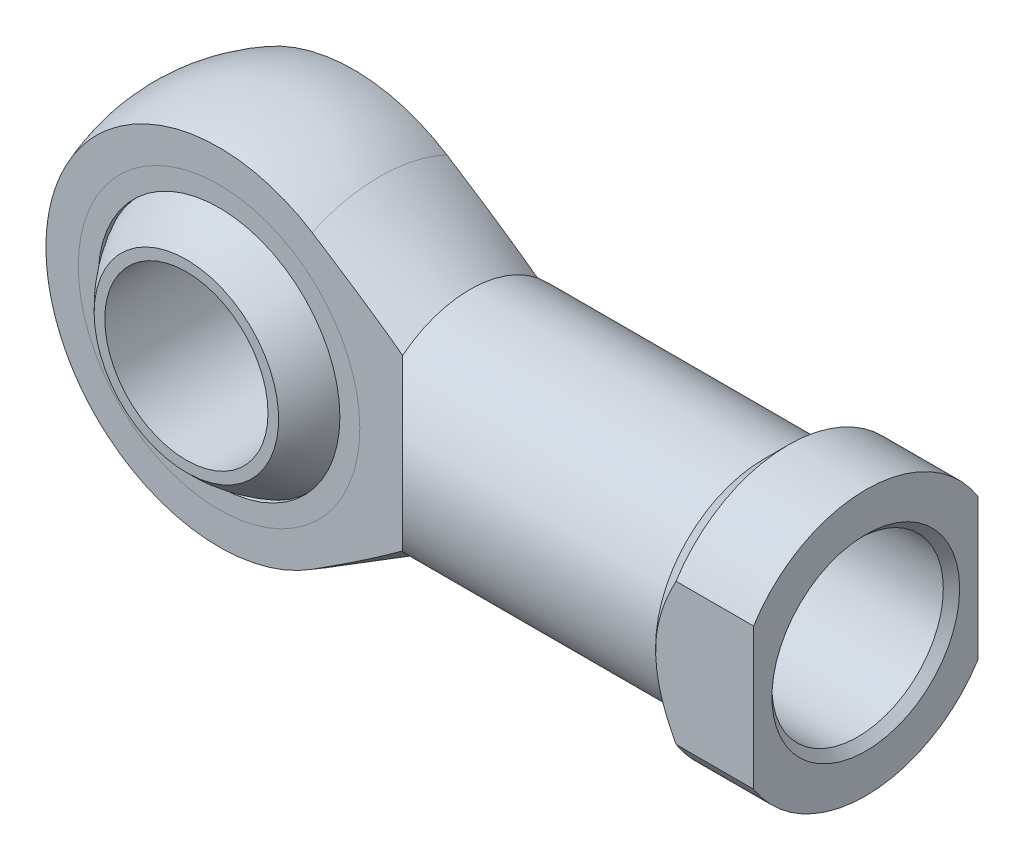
ISO-10303-21;
HEADER;
FILE_DESCRIPTION(('STEP AP214'),'2;1');
FILE_NAME('part.step','',(''),(''),'','','');
FILE_SCHEMA(('AUTOMOTIVE_DESIGN { 1 0 10303 214 1 1 1 1 }'));
ENDSEC;
DATA;
#1=APPLICATION_CONTEXT('core data for automotive mechanical design processes');
#2=APPLICATION_PROTOCOL_DEFINITION('international standard','automotive_design',2000,#1);
#3=PRODUCT_CONTEXT('',#1,'mechanical');
#4=PRODUCT('Part','Part','',(#3));
#5=PRODUCT_RELATED_PRODUCT_CATEGORY('part','',(#4));
#6=PRODUCT_DEFINITION_FORMATION('','',#4);
#7=PRODUCT_DEFINITION_CONTEXT('part definition',#1,'design');
#8=PRODUCT_DEFINITION('design','',#6,#7);
#9=PRODUCT_DEFINITION_SHAPE('','',#8);
#10=(LENGTH_UNIT() NAMED_UNIT(*) SI_UNIT(.MILLI.,.METRE.));
#11=(NAMED_UNIT(*) PLANE_ANGLE_UNIT() SI_UNIT($,.RADIAN.));
#12=(NAMED_UNIT(*) SI_UNIT($,.STERADIAN.) SOLID_ANGLE_UNIT());
#13=UNCERTAINTY_MEASURE_WITH_UNIT(LENGTH_MEASURE(1.E-05),#10,'distance_accuracy_value','');
#14=(GEOMETRIC_REPRESENTATION_CONTEXT(3) GLOBAL_UNCERTAINTY_ASSIGNED_CONTEXT((#13)) GLOBAL_UNIT_ASSIGNED_CONTEXT((#10,
#11,#12)) REPRESENTATION_CONTEXT('',''));
#15=CARTESIAN_POINT('',(0.,0.,0.));
#16=DIRECTION('',(0.,0.,1.));
#17=DIRECTION('',(1.,0.,0.));
#18=AXIS2_PLACEMENT_3D('',#15,#16,#17);
#19=CARTESIAN_POINT('',(0.,0.,0.));
#20=DIRECTION('',(0.,1.,0.));
#21=DIRECTION('',(1.,0.,0.));
#22=AXIS2_PLACEMENT_3D('',#19,#20,#21);
#23=SPHERICAL_SURFACE('',#22,33.335);
#24=CARTESIAN_POINT('',(0.,0.,0.));
#25=DIRECTION('',(0.,0.,-1.));
#26=DIRECTION('',(-1.,0.,0.));
#27=AXIS2_PLACEMENT_3D('',#24,#25,#26);
#28=SPHERICAL_SURFACE('',#27,33.335);
#29=CARTESIAN_POINT('',(0.,0.,24.5));
#30=DIRECTION('',(0.,0.,-1.));
#31=DIRECTION('',(-1.,0.,0.));
#32=AXIS2_PLACEMENT_3D('',#29,#30,#31);
#33=CIRCLE('',#32,22.604694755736);
#34=CARTESIAN_POINT('',(-22.604694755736,0.,24.5));
#35=VERTEX_POINT('',#34);
#36=EDGE_CURVE('P0_E26',#35,#35,#33,.F.);
#37=ORIENTED_EDGE('',*,*,#36,.F.);
#38=EDGE_LOOP('',(#37));
#39=FACE_BOUND('',#38,.T.);
#40=CARTESIAN_POINT('',(0.,0.,-24.5));
#41=DIRECTION('',(0.,0.,1.));
#42=DIRECTION('',(1.,0.,0.));
#43=AXIS2_PLACEMENT_3D('',#40,#41,#42);
#44=CIRCLE('',#43,22.604694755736);
#45=CARTESIAN_POINT('',(22.604694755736,0.,-24.5));
#46=VERTEX_POINT('',#45);
#47=EDGE_CURVE('P0_E10',#46,#46,#44,.F.);
#48=ORIENTED_EDGE('',*,*,#47,.F.);
#49=EDGE_LOOP('',(#48));
#50=FACE_BOUND('',#49,.T.);
#51=ADVANCED_FACE('P0_F14',(#39,#50),#28,.T.);
#52=CARTESIAN_POINT('',(0.,0.,-33.335));
#53=DIRECTION('',(0.,0.,1.));
#54=DIRECTION('',(1.,0.,0.));
#55=AXIS2_PLACEMENT_3D('',#52,#53,#54);
#56=CYLINDRICAL_SURFACE('',#55,20.);
#57=CARTESIAN_POINT('',(0.,0.,24.5));
#58=DIRECTION('',(0.,0.,-1.));
#59=DIRECTION('',(-1.,0.,0.));
#60=AXIS2_PLACEMENT_3D('',#57,#58,#59);
#61=CIRCLE('',#60,20.);
#62=CARTESIAN_POINT('',(-20.,0.,24.5));
#63=VERTEX_POINT('',#62);
#64=EDGE_CURVE('P0_E17',#63,#63,#61,.F.);
#65=ORIENTED_EDGE('',*,*,#64,.T.);
#66=EDGE_LOOP('',(#65));
#67=FACE_BOUND('',#66,.T.);
#68=CARTESIAN_POINT('',(0.,0.,-24.5));
#69=DIRECTION('',(0.,0.,1.));
#70=DIRECTION('',(1.,0.,0.));
#71=AXIS2_PLACEMENT_3D('',#68,#69,#70);
#72=CIRCLE('',#71,20.);
#73=CARTESIAN_POINT('',(20.,0.,-24.5));
#74=VERTEX_POINT('',#73);
#75=EDGE_CURVE('P0_E21',#74,#74,#72,.F.);
#76=ORIENTED_EDGE('',*,*,#75,.T.);
#77=EDGE_LOOP('',(#76));
#78=FACE_BOUND('',#77,.T.);
#79=ADVANCED_FACE('P0_F34',(#67,#78),#56,.F.);
#80=CARTESIAN_POINT('',(-33.335,-33.335,-24.5));
#81=DIRECTION('',(0.,0.,1.));
#82=DIRECTION('',(1.,0.,0.));
#83=AXIS2_PLACEMENT_3D('',#80,#81,#82);
#84=PLANE('',#83);
#85=ORIENTED_EDGE('',*,*,#47,.T.);
#86=EDGE_LOOP('',(#85));
#87=FACE_BOUND('',#86,.T.);
#88=ORIENTED_EDGE('',*,*,#75,.F.);
#89=EDGE_LOOP('',(#88));
#90=FACE_BOUND('',#89,.T.);
#91=ADVANCED_FACE('P0_F39',(#87,#90),#84,.F.);
#92=CARTESIAN_POINT('',(-33.335,-33.335,24.5));
#93=DIRECTION('',(0.,0.,-1.));
#94=DIRECTION('',(-1.,0.,0.));
#95=AXIS2_PLACEMENT_3D('',#92,#93,#94);
#96=PLANE('',#95);
#97=ORIENTED_EDGE('',*,*,#36,.T.);
#98=EDGE_LOOP('',(#97));
#99=FACE_BOUND('',#98,.T.);
#100=ORIENTED_EDGE('',*,*,#64,.F.);
#101=EDGE_LOOP('',(#100));
#102=FACE_BOUND('',#101,.T.);
#103=ADVANCED_FACE('P0_F37',(#99,#102),#96,.F.);
#104=CLOSED_SHELL('',(#51,#79,#91,#103));
#105=MANIFOLD_SOLID_BREP('P0_B1',#104);
#106=CARTESIAN_POINT('',(0.,0.,16.5));
#107=DIRECTION('',(0.,0.,1.));
#108=DIRECTION('',(1.,0.,0.));
#109=AXIS2_PLACEMENT_3D('',#106,#107,#108);
#110=PLANE('',#109);
#111=CARTESIAN_POINT('',(0.,0.,16.5));
#112=DIRECTION('',(0.,0.,1.));
#113=DIRECTION('',(1.,0.,0.));
#114=AXIS2_PLACEMENT_3D('',#111,#112,#113);
#115=CIRCLE('',#114,34.5);
#116=CARTESIAN_POINT('',(34.5,0.,16.5));
#117=VERTEX_POINT('',#116);
#118=EDGE_CURVE('P1_E10',#117,#117,#115,.T.);
#119=ORIENTED_EDGE('',*,*,#118,.T.);
#120=EDGE_LOOP('',(#119));
#121=FACE_BOUND('',#120,.T.);
#122=CARTESIAN_POINT('',(0.,0.,16.5));
#123=DIRECTION('',(0.,0.,1.));
#124=DIRECTION('',(1.,0.,0.));
#125=AXIS2_PLACEMENT_3D('',#122,#123,#124);
#126=CIRCLE('',#125,29.615);
#127=CARTESIAN_POINT('',(29.615,0.,16.5));
#128=VERTEX_POINT('',#127);
#129=EDGE_CURVE('P1_E25',#128,#128,#126,.T.);
#130=ORIENTED_EDGE('',*,*,#129,.F.);
#131=EDGE_LOOP('',(#130));
#132=FACE_BOUND('',#131,.T.);
#133=ADVANCED_FACE('P1_F14',(#121,#132),#110,.T.);
#134=CARTESIAN_POINT('',(0.,0.,15.3));
#135=DIRECTION('',(0.,0.,1.));
#136=DIRECTION('',(1.,0.,0.));
#137=AXIS2_PLACEMENT_3D('',#134,#135,#136);
#138=PLANE('',#137);
#139=CARTESIAN_POINT('',(0.,0.,15.3));
#140=DIRECTION('',(0.,0.,1.));
#141=DIRECTION('',(1.,0.,0.));
#142=AXIS2_PLACEMENT_3D('',#139,#140,#141);
#143=CIRCLE('',#142,34.5);
#144=CARTESIAN_POINT('',(34.5,0.,15.3));
#145=VERTEX_POINT('',#144);
#146=EDGE_CURVE('P1_E18',#145,#145,#143,.T.);
#147=ORIENTED_EDGE('',*,*,#146,.F.);
#148=EDGE_LOOP('',(#147));
#149=FACE_BOUND('',#148,.T.);
#150=CARTESIAN_POINT('',(0.,0.,15.3));
#151=DIRECTION('',(0.,0.,1.));
#152=DIRECTION('',(1.,0.,0.));
#153=AXIS2_PLACEMENT_3D('',#150,#151,#152);
#154=CIRCLE('',#153,29.615);
#155=CARTESIAN_POINT('',(29.615,0.,15.3));
#156=VERTEX_POINT('',#155);
#157=EDGE_CURVE('P1_E27',#156,#156,#154,.T.);
#158=ORIENTED_EDGE('',*,*,#157,.T.);
#159=EDGE_LOOP('',(#158));
#160=FACE_BOUND('',#159,.T.);
#161=ADVANCED_FACE('P1_F37',(#149,#160),#138,.F.);
#162=CARTESIAN_POINT('',(0.,0.,16.5));
#163=DIRECTION('',(0.,0.,-1.));
#164=DIRECTION('',(-1.,0.,0.));
#165=AXIS2_PLACEMENT_3D('',#162,#163,#164);
#166=CYLINDRICAL_SURFACE('',#165,34.5);
#167=ORIENTED_EDGE('',*,*,#118,.F.);
#168=EDGE_LOOP('',(#167));
#169=FACE_BOUND('',#168,.T.);
#170=ORIENTED_EDGE('',*,*,#146,.T.);
#171=EDGE_LOOP('',(#170));
#172=FACE_BOUND('',#171,.T.);
#173=ADVANCED_FACE('P1_F16',(#169,#172),#166,.T.);
#174=CARTESIAN_POINT('',(0.,0.,16.5));
#175=DIRECTION('',(0.,0.,-1.));
#176=DIRECTION('',(-1.,0.,0.));
#177=AXIS2_PLACEMENT_3D('',#174,#175,#176);
#178=CYLINDRICAL_SURFACE('',#177,29.615);
#179=ORIENTED_EDGE('',*,*,#129,.T.);
#180=EDGE_LOOP('',(#179));
#181=FACE_BOUND('',#180,.T.);
#182=ORIENTED_EDGE('',*,*,#157,.F.);
#183=EDGE_LOOP('',(#182));
#184=FACE_BOUND('',#183,.T.);
#185=ADVANCED_FACE('P1_F33',(#181,#184),#178,.F.);
#186=CLOSED_SHELL('',(#133,#161,#173,#185));
#187=MANIFOLD_SOLID_BREP('P1_B1',#186);
#188=CARTESIAN_POINT('',(0.,0.,-15.3));
#189=DIRECTION('',(0.,0.,1.));
#190=DIRECTION('',(1.,0.,0.));
#191=AXIS2_PLACEMENT_3D('',#188,#189,#190);
#192=PLANE('',#191);
#193=CARTESIAN_POINT('',(0.,0.,-15.3));
#194=DIRECTION('',(0.,0.,1.));
#195=DIRECTION('',(1.,0.,0.));
#196=AXIS2_PLACEMENT_3D('',#193,#194,#195);
#197=CIRCLE('',#196,34.5);
#198=CARTESIAN_POINT('',(34.5,0.,-15.3));
#199=VERTEX_POINT('',#198);
#200=EDGE_CURVE('P2_E10',#199,#199,#197,.T.);
#201=ORIENTED_EDGE('',*,*,#200,.T.);
#202=EDGE_LOOP('',(#201));
#203=FACE_BOUND('',#202,.T.);
#204=CARTESIAN_POINT('',(0.,0.,-15.3));
#205=DIRECTION('',(0.,0.,1.));
#206=DIRECTION('',(1.,0.,0.));
#207=AXIS2_PLACEMENT_3D('',#204,#205,#206);
#208=CIRCLE('',#207,29.615);
#209=CARTESIAN_POINT('',(29.615,0.,-15.3));
#210=VERTEX_POINT('',#209);
#211=EDGE_CURVE('P2_E25',#210,#210,#208,.T.);
#212=ORIENTED_EDGE('',*,*,#211,.F.);
#213=EDGE_LOOP('',(#212));
#214=FACE_BOUND('',#213,.T.);
#215=ADVANCED_FACE('P2_F14',(#203,#214),#192,.T.);
#216=CARTESIAN_POINT('',(0.,0.,-16.5));
#217=DIRECTION('',(0.,0.,1.));
#218=DIRECTION('',(1.,0.,0.));
#219=AXIS2_PLACEMENT_3D('',#216,#217,#218);
#220=PLANE('',#219);
#221=CARTESIAN_POINT('',(0.,0.,-16.5));
#222=DIRECTION('',(0.,0.,1.));
#223=DIRECTION('',(1.,0.,0.));
#224=AXIS2_PLACEMENT_3D('',#221,#222,#223);
#225=CIRCLE('',#224,34.5);
#226=CARTESIAN_POINT('',(34.5,0.,-16.5));
#227=VERTEX_POINT('',#226);
#228=EDGE_CURVE('P2_E18',#227,#227,#225,.T.);
#229=ORIENTED_EDGE('',*,*,#228,.F.);
#230=EDGE_LOOP('',(#229));
#231=FACE_BOUND('',#230,.T.);
#232=CARTESIAN_POINT('',(0.,0.,-16.5));
#233=DIRECTION('',(0.,0.,1.));
#234=DIRECTION('',(1.,0.,0.));
#235=AXIS2_PLACEMENT_3D('',#232,#233,#234);
#236=CIRCLE('',#235,29.615);
#237=CARTESIAN_POINT('',(29.615,0.,-16.5));
#238=VERTEX_POINT('',#237);
#239=EDGE_CURVE('P2_E27',#238,#238,#236,.T.);
#240=ORIENTED_EDGE('',*,*,#239,.T.);
#241=EDGE_LOOP('',(#240));
#242=FACE_BOUND('',#241,.T.);
#243=ADVANCED_FACE('P2_F37',(#231,#242),#220,.F.);
#244=CARTESIAN_POINT('',(0.,0.,-15.3));
#245=DIRECTION('',(0.,0.,-1.));
#246=DIRECTION('',(-1.,0.,0.));
#247=AXIS2_PLACEMENT_3D('',#244,#245,#246);
#248=CYLINDRICAL_SURFACE('',#247,34.5);
#249=ORIENTED_EDGE('',*,*,#200,.F.);
#250=EDGE_LOOP('',(#249));
#251=FACE_BOUND('',#250,.T.);
#252=ORIENTED_EDGE('',*,*,#228,.T.);
#253=EDGE_LOOP('',(#252));
#254=FACE_BOUND('',#253,.T.);
#255=ADVANCED_FACE('P2_F16',(#251,#254),#248,.T.);
#256=CARTESIAN_POINT('',(0.,0.,-15.3));
#257=DIRECTION('',(0.,0.,-1.));
#258=DIRECTION('',(-1.,0.,0.));
#259=AXIS2_PLACEMENT_3D('',#256,#257,#258);
#260=CYLINDRICAL_SURFACE('',#259,29.615);
#261=ORIENTED_EDGE('',*,*,#211,.T.);
#262=EDGE_LOOP('',(#261));
#263=FACE_BOUND('',#262,.T.);
#264=ORIENTED_EDGE('',*,*,#239,.F.);
#265=EDGE_LOOP('',(#264));
#266=FACE_BOUND('',#265,.T.);
#267=ADVANCED_FACE('P2_F33',(#263,#266),#260,.F.);
#268=CLOSED_SHELL('',(#215,#243,#255,#267));
#269=MANIFOLD_SOLID_BREP('P2_B1',#268);
#270=CARTESIAN_POINT('',(0.,0.,0.));
#271=DIRECTION('',(0.,1.,0.));
#272=DIRECTION('',(1.,0.,0.));
#273=AXIS2_PLACEMENT_3D('',#270,#271,#272);
#274=SPHERICAL_SURFACE('',#273,33.335);
#275=CARTESIAN_POINT('',(0.,0.,0.));
#276=DIRECTION('',(0.,0.,1.));
#277=DIRECTION('',(1.,0.,0.));
#278=AXIS2_PLACEMENT_3D('',#275,#276,#277);
#279=SPHERICAL_SURFACE('',#278,33.335);
#280=CARTESIAN_POINT('',(0.,0.,15.3));
#281=DIRECTION('',(0.,0.,1.));
#282=DIRECTION('',(1.,0.,0.));
#283=AXIS2_PLACEMENT_3D('',#280,#281,#282);
#284=CIRCLE('',#283,29.6164181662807);
#285=CARTESIAN_POINT('',(29.6164181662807,0.,15.3));
#286=VERTEX_POINT('',#285);
#287=EDGE_CURVE('P3_E73',#286,#286,#284,.F.);
#288=ORIENTED_EDGE('',*,*,#287,.F.);
#289=EDGE_LOOP('',(#288));
#290=FACE_BOUND('',#289,.T.);
#291=CARTESIAN_POINT('',(0.,0.,-15.3));
#292=DIRECTION('',(0.,0.,-1.));
#293=DIRECTION('',(-1.,0.,0.));
#294=AXIS2_PLACEMENT_3D('',#291,#292,#293);
#295=CIRCLE('',#294,29.6164181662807);
#296=CARTESIAN_POINT('',(-29.6164181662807,0.,-15.3));
#297=VERTEX_POINT('',#296);
#298=EDGE_CURVE('P3_E20',#297,#297,#295,.F.);
#299=ORIENTED_EDGE('',*,*,#298,.F.);
#300=EDGE_LOOP('',(#299));
#301=FACE_BOUND('',#300,.T.);
#302=ADVANCED_FACE('P3_F16',(#290,#301),#279,.F.);
#303=CARTESIAN_POINT('',(-45.,-45.5,-16.5));
#304=DIRECTION('',(0.,0.,1.));
#305=DIRECTION('',(1.,0.,0.));
#306=AXIS2_PLACEMENT_3D('',#303,#304,#305);
#307=PLANE('',#306);
#308=CARTESIAN_POINT('',(0.,0.,-16.5));
#309=DIRECTION('',(0.,0.,1.));
#310=DIRECTION('',(1.,0.,0.));
#311=AXIS2_PLACEMENT_3D('',#308,#309,#310);
#312=CIRCLE('',#311,42.4028300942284);
#313=CARTESIAN_POINT('',(22.8271894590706,35.7340093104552,-16.5));
#314=VERTEX_POINT('',#313);
#315=CARTESIAN_POINT('',(22.8271894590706,-35.7340093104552,-16.5));
#316=VERTEX_POINT('',#315);
#317=EDGE_CURVE('P3_E11',#314,#316,#312,.T.);
#318=ORIENTED_EDGE('',*,*,#317,.F.);
#319=CARTESIAN_POINT('',(-220.355528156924,-179.641175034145,-16.5));
#320=CARTESIAN_POINT('',(-216.029623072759,-177.121731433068,-16.5));
#321=CARTESIAN_POINT('',(-211.703908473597,-174.601960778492,-16.5));
#322=CARTESIAN_POINT('',(-203.052918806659,-169.561664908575,-16.5));
#323=CARTESIAN_POINT('',(-198.727643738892,-167.041139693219,-16.5));
#324=CARTESIAN_POINT('',(-185.752552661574,-159.478273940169,-16.5));
#325=CARTESIAN_POINT('',(-177.10348401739,-154.434651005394,-16.5));
#326=CARTESIAN_POINT('',(-159.807498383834,-144.342557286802,-16.5));
#327=CARTESIAN_POINT('',(-151.160581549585,-139.294086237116,-16.5));
#328=CARTESIAN_POINT('',(-133.870401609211,-129.190914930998,-16.5));
#329=CARTESIAN_POINT('',(-125.22713849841,-124.136214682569,-16.5));
#330=CARTESIAN_POINT('',(-112.267630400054,-116.548303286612,-16.5));
#331=CARTESIAN_POINT('',(-107.949419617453,-114.018449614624,-16.5));
#332=CARTESIAN_POINT('',(-99.3146053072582,-108.95600080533,-16.5));
#333=CARTESIAN_POINT('',(-94.9980017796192,-106.423405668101,-16.5));
#334=CARTESIAN_POINT('',(-86.3667586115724,-101.35483072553,-16.5));
#335=CARTESIAN_POINT('',(-82.05211897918,-98.8188509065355,-16.5));
#336=CARTESIAN_POINT('',(-73.425327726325,-93.7426640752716,-16.5));
#337=CARTESIAN_POINT('',(-69.113176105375,-91.2024570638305,-16.5));
#338=CARTESIAN_POINT('',(-60.4921769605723,-86.1167176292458,-16.5));
#339=CARTESIAN_POINT('',(-56.1833293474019,-83.5711853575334,-16.5));
#340=CARTESIAN_POINT('',(-47.5697917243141,-78.4730960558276,-16.5));
#341=CARTESIAN_POINT('',(-43.2651017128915,-75.9205390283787,-16.5));
#342=CARTESIAN_POINT('',(-36.8122909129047,-72.0846270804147,-16.5));
#343=CARTESIAN_POINT('',(-34.6620644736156,-70.8048142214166,-16.5));
#344=CARTESIAN_POINT('',(-30.3632695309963,-68.2424073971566,-16.5));
#345=CARTESIAN_POINT('',(-28.2147010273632,-66.9598134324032,-16.5));
#346=CARTESIAN_POINT('',(-23.9195308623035,-64.3913442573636,-16.5));
#347=CARTESIAN_POINT('',(-21.7729291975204,-63.1054690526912,-16.5));
#348=CARTESIAN_POINT('',(-17.4820785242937,-60.5298000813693,-16.5));
#349=CARTESIAN_POINT('',(-15.3378295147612,-59.2400063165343,-16.5));
#350=CARTESIAN_POINT('',(-11.8914334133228,-57.1617606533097,-16.5));
#351=CARTESIAN_POINT('',(-10.5883862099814,-56.3748013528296,-16.5));
#352=CARTESIAN_POINT('',(-7.98349119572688,-54.7988987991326,-16.5));
#353=CARTESIAN_POINT('',(-6.68164338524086,-54.0099555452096,-16.5));
#354=CARTESIAN_POINT('',(-4.07930806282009,-52.4298155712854,-16.5));
#355=CARTESIAN_POINT('',(-2.77882055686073,-51.6386188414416,-16.5));
#356=CARTESIAN_POINT('',(-0.179411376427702,-50.0536571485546,-16.5));
#357=CARTESIAN_POINT('',(1.11951029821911,-49.2598921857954,-16.5));
#358=CARTESIAN_POINT('',(3.71586421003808,-47.6692180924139,-16.5));
#359=CARTESIAN_POINT('',(5.01329600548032,-46.8723082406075,-16.5));
#360=CARTESIAN_POINT('',(7.60605676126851,-45.2750752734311,-16.5));
#361=CARTESIAN_POINT('',(8.90138572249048,-44.4747521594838,-16.5));
#362=CARTESIAN_POINT('',(11.4895701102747,-42.8701324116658,-16.5));
#363=CARTESIAN_POINT('',(12.7824255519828,-42.0658358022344,-16.5));
#364=CARTESIAN_POINT('',(15.3652133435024,-40.4525643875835,-16.5));
#365=CARTESIAN_POINT('',(16.6551456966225,-39.6435895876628,-16.5));
#366=CARTESIAN_POINT('',(19.5488502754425,-37.8201242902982,-16.5));
#367=CARTESIAN_POINT('',(21.1516559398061,-36.8040986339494,-16.5));
#368=CARTESIAN_POINT('',(24.3503889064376,-34.7612206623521,-16.5));
#369=CARTESIAN_POINT('',(25.9463161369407,-33.7343682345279,-16.5));
#370=CARTESIAN_POINT('',(28.3330407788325,-32.1839035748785,-16.5));
#371=CARTESIAN_POINT('',(29.1272298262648,-31.6655111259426,-16.5));
#372=CARTESIAN_POINT('',(30.7129885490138,-30.6247368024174,-16.5));
#373=CARTESIAN_POINT('',(31.5045582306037,-30.1023549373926,-16.5));
#374=CARTESIAN_POINT('',(33.0846359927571,-29.0530158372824,-16.5));
#375=CARTESIAN_POINT('',(33.8731441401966,-28.5260587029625,-16.5));
#376=CARTESIAN_POINT('',(35.4465787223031,-27.4668260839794,-16.5));
#377=CARTESIAN_POINT('',(36.2315051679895,-26.9345506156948,-16.5));
#378=CARTESIAN_POINT('',(37.9996411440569,-25.7252752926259,-16.5));
#379=CARTESIAN_POINT('',(38.9816111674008,-25.046460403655,-16.5));
#380=CARTESIAN_POINT('',(40.9371266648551,-23.6766893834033,-16.5));
#381=CARTESIAN_POINT('',(41.9106718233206,-22.9857328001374,-16.5));
#382=CARTESIAN_POINT('',(43.3634487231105,-21.937380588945,-16.5));
#383=CARTESIAN_POINT('',(43.8467964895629,-21.5856858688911,-16.5));
#384=CARTESIAN_POINT('',(44.8103090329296,-20.8779807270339,-16.5));
#385=CARTESIAN_POINT('',(45.2904738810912,-20.5219704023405,-16.5));
#386=CARTESIAN_POINT('',(46.2470724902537,-19.8050957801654,-16.5));
#387=CARTESIAN_POINT('',(46.7235067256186,-19.4442321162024,-16.5));
#388=CARTESIAN_POINT('',(47.6721330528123,-18.7168826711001,-16.5));
#389=CARTESIAN_POINT('',(48.1443247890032,-18.3503964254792,-16.5));
#390=CARTESIAN_POINT('',(49.0258569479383,-17.6564973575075,-16.5));
#391=CARTESIAN_POINT('',(49.4357808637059,-17.3298263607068,-16.5));
#392=CARTESIAN_POINT('',(50.2510946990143,-16.6708770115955,-16.5));
#393=CARTESIAN_POINT('',(50.6564846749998,-16.3385987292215,-16.5));
#394=CARTESIAN_POINT('',(51.4618933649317,-15.6676722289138,-16.5));
#395=CARTESIAN_POINT('',(51.861912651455,-15.3290246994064,-16.5));
#396=CARTESIAN_POINT('',(52.655604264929,-14.6443865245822,-16.5));
#397=CARTESIAN_POINT('',(53.0492768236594,-14.2983961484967,-16.5));
#398=CARTESIAN_POINT('',(53.828440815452,-13.5984253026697,-16.5));
#399=CARTESIAN_POINT('',(54.2139432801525,-13.2444571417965,-16.5));
#400=CARTESIAN_POINT('',(54.9757208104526,-12.5266533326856,-16.5));
#401=CARTESIAN_POINT('',(55.3519953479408,-12.1628171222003,-16.5));
#402=CARTESIAN_POINT('',(56.0928405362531,-11.423907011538,-16.5));
#403=CARTESIAN_POINT('',(56.4574194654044,-11.0488414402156,-16.5));
#404=CARTESIAN_POINT('',(57.1721914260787,-10.2852942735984,-16.5));
#405=CARTESIAN_POINT('',(57.5223871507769,-9.89681521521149,-16.5));
#406=CARTESIAN_POINT('',(58.1427930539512,-9.17570765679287,-16.5));
#407=CARTESIAN_POINT('',(58.4160173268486,-8.84567999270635,-16.5));
#408=CARTESIAN_POINT('',(58.9472798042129,-8.17348172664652,-16.5));
#409=CARTESIAN_POINT('',(59.2053161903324,-7.83130967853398,-16.5));
#410=CARTESIAN_POINT('',(59.7022959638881,-7.1334035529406,-16.5));
#411=CARTESIAN_POINT('',(59.94124368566,-6.7776725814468,-16.5));
#412=CARTESIAN_POINT('',(60.3951205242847,-6.05117408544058,-16.5));
#413=CARTESIAN_POINT('',(60.6100568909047,-5.68041114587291,-16.5));
#414=CARTESIAN_POINT('',(60.9599996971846,-5.01694438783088,-16.5));
#415=CARTESIAN_POINT('',(61.1015988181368,-4.72772687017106,-16.5));
#416=CARTESIAN_POINT('',(61.3645343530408,-4.14011316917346,-16.5));
#417=CARTESIAN_POINT('',(61.4858693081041,-3.84171632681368,-16.5));
#418=CARTESIAN_POINT('',(61.7044872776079,-3.2371157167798,-16.5));
#419=CARTESIAN_POINT('',(61.8018372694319,-2.93093638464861,-16.5));
#420=CARTESIAN_POINT('',(61.969430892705,-2.31134544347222,-16.5));
#421=CARTESIAN_POINT('',(62.0396906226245,-1.99793824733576,-16.5));
#422=CARTESIAN_POINT('',(62.1434734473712,-1.4043970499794,-16.5));
#423=CARTESIAN_POINT('',(62.1804311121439,-1.12486504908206,-16.5));
#424=CARTESIAN_POINT('',(62.2298855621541,-0.563563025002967,-16.5));
#425=CARTESIAN_POINT('',(62.2423768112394,-0.281792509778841,-16.5));
#426=CARTESIAN_POINT('',(62.2423668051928,0.324177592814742,-16.5));
#427=CARTESIAN_POINT('',(62.2258237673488,0.648384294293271,-16.5));
#428=CARTESIAN_POINT('',(62.1604762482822,1.2936483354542,-16.5));
#429=CARTESIAN_POINT('',(62.1116540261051,1.61470384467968,-16.5));
#430=CARTESIAN_POINT('',(61.9839161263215,2.25151835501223,-16.5));
#431=CARTESIAN_POINT('',(61.904927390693,2.56726253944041,-16.5));
#432=CARTESIAN_POINT('',(61.7201606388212,3.19071642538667,-16.5));
#433=CARTESIAN_POINT('',(61.6143814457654,3.49842577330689,-16.5));
#434=CARTESIAN_POINT('',(61.3301567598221,4.23262491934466,-16.5));
#435=CARTESIAN_POINT('',(61.1398736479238,4.65452719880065,-16.5));
#436=CARTESIAN_POINT('',(60.7223011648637,5.47955537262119,-16.5));
#437=CARTESIAN_POINT('',(60.4949880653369,5.88266901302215,-16.5));
#438=CARTESIAN_POINT('',(60.0108959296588,6.67229215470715,-16.5));
#439=CARTESIAN_POINT('',(59.7540317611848,7.05874904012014,-16.5));
#440=CARTESIAN_POINT('',(59.3519230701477,7.62626109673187,-16.5));
#441=CARTESIAN_POINT('',(59.2151008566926,7.81338284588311,-16.5));
#442=CARTESIAN_POINT('',(58.9364488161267,8.18386579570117,-16.5));
#443=CARTESIAN_POINT('',(58.794618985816,8.36722699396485,-16.5));
#444=CARTESIAN_POINT('',(58.4097543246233,8.85243509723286,-16.5));
#445=CARTESIAN_POINT('',(58.1627397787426,9.15112722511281,-16.5));
#446=CARTESIAN_POINT('',(57.658485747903,9.73978384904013,-16.5));
#447=CARTESIAN_POINT('',(57.4012447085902,10.0297470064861,-16.5));
#448=CARTESIAN_POINT('',(56.8781317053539,10.6020453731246,-16.5));
#449=CARTESIAN_POINT('',(56.6122552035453,10.8843764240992,-16.5));
#450=CARTESIAN_POINT('',(56.0733451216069,11.4421407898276,-16.5));
#451=CARTESIAN_POINT('',(55.8003110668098,11.7175736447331,-16.5));
#452=CARTESIAN_POINT('',(55.2475548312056,12.2629187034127,-16.5));
#453=CARTESIAN_POINT('',(54.9678187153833,12.532816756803,-16.5));
#454=CARTESIAN_POINT('',(54.403136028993,13.0671133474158,-16.5));
#455=CARTESIAN_POINT('',(54.1181892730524,13.3315116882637,-16.5));
#456=CARTESIAN_POINT('',(53.2568336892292,14.1171845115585,-16.5));
#457=CARTESIAN_POINT('',(52.6737228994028,14.6311190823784,-16.5));
#458=CARTESIAN_POINT('',(51.4903665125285,15.6463181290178,-16.5));
#459=CARTESIAN_POINT('',(50.8900370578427,16.1474842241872,-16.5));
#460=CARTESIAN_POINT('',(49.6787007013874,17.1367818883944,-16.5));
#461=CARTESIAN_POINT('',(49.067693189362,17.6249127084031,-16.5));
#462=CARTESIAN_POINT('',(47.8381604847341,18.5896410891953,-16.5));
#463=CARTESIAN_POINT('',(47.2196481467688,19.0662550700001,-16.5));
#464=CARTESIAN_POINT('',(46.2867692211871,19.7744037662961,-16.5));
#465=CARTESIAN_POINT('',(45.9749618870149,20.0093216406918,-16.5));
#466=CARTESIAN_POINT('',(45.3497947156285,20.4770830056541,-16.5));
#467=CARTESIAN_POINT('',(45.0364348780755,20.709926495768,-16.5));
#468=CARTESIAN_POINT('',(44.1038787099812,21.3984872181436,-16.5));
#469=CARTESIAN_POINT('',(43.4826575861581,21.8514638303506,-16.5));
#470=CARTESIAN_POINT('',(42.2356576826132,22.7511064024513,-16.5));
#471=CARTESIAN_POINT('',(41.6098788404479,23.1977722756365,-16.5));
#472=CARTESIAN_POINT('',(40.3544420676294,24.0856779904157,-16.5));
#473=CARTESIAN_POINT('',(39.7247839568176,24.5269175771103,-16.5));
#474=CARTESIAN_POINT('',(38.4621737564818,25.4046611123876,-16.5));
#475=CARTESIAN_POINT('',(37.829221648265,25.8411650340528,-16.5));
#476=CARTESIAN_POINT('',(35.9258721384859,27.1446643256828,-16.5));
#477=CARTESIAN_POINT('',(34.6512339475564,28.0054695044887,-16.5));
#478=CARTESIAN_POINT('',(32.0934367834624,29.7142235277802,-16.5));
#479=CARTESIAN_POINT('',(30.8102780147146,30.5621726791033,-16.5));
#480=CARTESIAN_POINT('',(28.2357992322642,32.2488180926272,-16.5));
#481=CARTESIAN_POINT('',(26.944471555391,33.087502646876,-16.5));
#482=CARTESIAN_POINT('',(24.3564729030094,34.7565924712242,-16.5));
#483=CARTESIAN_POINT('',(23.0598018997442,35.5869976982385,-16.5));
#484=CARTESIAN_POINT('',(20.4622845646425,37.2409089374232,-16.5));
#485=CARTESIAN_POINT('',(19.1614387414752,38.0644157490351,-16.5));
#486=CARTESIAN_POINT('',(16.5561884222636,39.7057721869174,-16.5));
#487=CARTESIAN_POINT('',(15.2517839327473,40.5236218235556,-16.5));
#488=CARTESIAN_POINT('',(12.6475401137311,42.149861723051,-16.5));
#489=CARTESIAN_POINT('',(11.3477178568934,42.9582793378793,-16.5));
#490=CARTESIAN_POINT('',(8.74559335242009,44.5711144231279,-16.5));
#491=CARTESIAN_POINT('',(7.44329110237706,45.3755318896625,-16.5));
#492=CARTESIAN_POINT('',(3.53316251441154,47.7837085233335,-16.5));
#493=CARTESIAN_POINT('',(0.922183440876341,49.3823488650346,-16.5));
#494=CARTESIAN_POINT('',(-4.30452239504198,52.5684906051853,-16.5));
#495=CARTESIAN_POINT('',(-6.92024562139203,54.1559978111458,-16.5));
#496=CARTESIAN_POINT('',(-10.8474092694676,56.5313098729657,-16.5));
#497=CARTESIAN_POINT('',(-12.1570541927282,57.3220854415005,-16.5));
#498=CARTESIAN_POINT('',(-14.7774063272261,58.9018745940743,-16.5));
#499=CARTESIAN_POINT('',(-16.088113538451,59.6908881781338,-16.5));
#500=CARTESIAN_POINT('',(-19.4912144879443,61.7367089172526,-16.5));
#501=CARTESIAN_POINT('',(-21.5843343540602,62.9923082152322,-16.5));
#502=CARTESIAN_POINT('',(-25.7725718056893,65.500170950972,-16.5));
#503=CARTESIAN_POINT('',(-27.8676893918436,66.7524343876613,-16.5));
#504=CARTESIAN_POINT('',(-34.155559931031,70.5050161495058,-16.5));
#505=CARTESIAN_POINT('',(-38.350826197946,73.0011232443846,-16.5));
#506=CARTESIAN_POINT('',(-46.7462735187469,77.9851270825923,-16.5));
#507=CARTESIAN_POINT('',(-50.9464546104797,80.4730237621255,-16.5));
#508=CARTESIAN_POINT('',(-59.35051249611,85.4425686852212,-16.5));
#509=CARTESIAN_POINT('',(-63.554389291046,87.9242169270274,-16.5));
#510=CARTESIAN_POINT('',(-71.9661240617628,92.8833297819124,-16.5));
#511=CARTESIAN_POINT('',(-76.1739828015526,95.3607930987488,-16.5));
#512=CARTESIAN_POINT('',(-84.591959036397,100.311880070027,-16.5));
#513=CARTESIAN_POINT('',(-88.8020765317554,102.785503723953,-16.5));
#514=CARTESIAN_POINT('',(-97.2241093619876,107.729650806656,-16.5));
#515=CARTESIAN_POINT('',(-101.436024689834,110.200174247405,-16.5));
#516=CARTESIAN_POINT('',(-109.861338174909,115.138691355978,-16.5));
#517=CARTESIAN_POINT('',(-114.074736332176,117.606685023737,-16.5));
#518=CARTESIAN_POINT('',(-126.788890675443,125.049779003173,-16.5));
#519=CARTESIAN_POINT('',(-135.291513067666,130.02169145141,-16.5));
#520=CARTESIAN_POINT('',(-152.300237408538,139.959583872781,-16.5));
#521=CARTESIAN_POINT('',(-160.80633936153,144.925563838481,-16.5));
#522=CARTESIAN_POINT('',(-177.818546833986,154.851675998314,-16.5));
#523=CARTESIAN_POINT('',(-186.324651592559,159.811809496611,-16.5));
#524=CARTESIAN_POINT('',(-199.08524199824,167.249535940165,-16.5));
#525=CARTESIAN_POINT('',(-203.339007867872,169.728363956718,-16.5));
#526=CARTESIAN_POINT('',(-211.846963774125,174.68529181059,-16.5));
#527=CARTESIAN_POINT('',(-216.101153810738,177.163391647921,-16.5));
#528=CARTESIAN_POINT('',(-220.355528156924,179.641175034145,-16.5));
#529=B_SPLINE_CURVE_WITH_KNOTS('',3,(#319,#320,#321,#322,#323,#324,#325,#326,#327,#328,#329,
#330,#331,#332,#333,#334,#335,#336,#337,#338,#339,#340,#341,#342,#343,#344,#345,#346,#347,#348,
#349,#350,#351,#352,#353,#354,#355,#356,#357,#358,#359,#360,#361,#362,#363,#364,#365,#366,#367,
#368,#369,#370,#371,#372,#373,#374,#375,#376,#377,#378,#379,#380,#381,#382,#383,#384,#385,#386,
#387,#388,#389,#390,#391,#392,#393,#394,#395,#396,#397,#398,#399,#400,#401,#402,#403,#404,#405,
#406,#407,#408,#409,#410,#411,#412,#413,#414,#415,#416,#417,#418,#419,#420,#421,#422,#423,#424,
#425,#426,#427,#428,#429,#430,#431,#432,#433,#434,#435,#436,#437,#438,#439,#440,#441,#442,#443,
#444,#445,#446,#447,#448,#449,#450,#451,#452,#453,#454,#455,#456,#457,#458,#459,#460,#461,#462,
#463,#464,#465,#466,#467,#468,#469,#470,#471,#472,#473,#474,#475,#476,#477,#478,#479,#480,#481,
#482,#483,#484,#485,#486,#487,#488,#489,#490,#491,#492,#493,#494,#495,#496,#497,#498,#499,#500,
#501,#502,#503,#504,#505,#506,#507,#508,#509,#510,#511,#512,#513,#514,#515,#516,#517,#518,#519,
#520,#521,#522,#523,#524,#525,#526,#527,#528),.UNSPECIFIED.,.F.,.F.,(4,2,2,2,2,2,2,2,2,2,2,2,2,
2,2,2,2,2,2,2,2,2,2,2,2,2,2,2,2,2,2,2,2,2,2,2,2,2,2,2,2,2,2,2,2,2,2,2,2,2,2,2,2,2,2,2,2,2,2,2,2,
2,2,2,2,2,2,2,2,2,2,2,2,2,2,2,2,2,2,2,2,2,2,2,2,2,2,2,2,2,2,2,2,2,2,2,2,2,2,2,2,2,2,2,4),(0.,
15.018304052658,30.0366083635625,60.0732629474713,90.1116713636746,120.150041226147,
135.164164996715,150.178288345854,165.192472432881,180.206653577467,195.220413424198,
210.234167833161,217.740999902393,225.247830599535,232.754648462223,240.26146284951,
244.828203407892,249.394945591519,253.961707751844,258.528469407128,263.096347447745,
267.664223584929,272.232071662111,276.799914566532,282.493005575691,288.186155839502,
291.031353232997,293.876543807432,296.721671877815,299.566791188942,303.147992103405,
306.729326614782,308.522580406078,310.315793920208,312.108775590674,313.901906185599,
315.474366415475,317.046807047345,318.619078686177,320.191292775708,321.761227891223,
323.33125264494,324.900140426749,326.468733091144,327.753728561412,329.03887756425,
330.323733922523,331.608201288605,332.573617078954,333.539102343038,334.501860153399,
335.464044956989,336.30891949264,337.153985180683,338.126159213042,339.098868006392,
340.073947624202,341.049070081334,342.435103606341,343.822028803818,345.213054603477,
345.908413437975,346.603772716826,347.766273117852,348.928950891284,350.092249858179,
351.255626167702,352.421677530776,353.587770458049,355.9191740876,358.265041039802,
360.611042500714,362.953474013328,364.124659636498,365.295845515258,367.602291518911,
369.908769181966,372.215354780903,374.521953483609,379.136076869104,383.750089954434,
388.369386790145,392.988707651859,397.607485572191,402.226255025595,406.818380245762,
411.410509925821,420.595013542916,429.774303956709,434.363906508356,438.953509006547,
446.276012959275,453.598519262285,468.243547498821,482.888689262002,497.533835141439,
512.182897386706,526.831961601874,541.480969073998,556.129976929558,585.678754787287,
615.227569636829,644.767553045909,659.537522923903,674.307492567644),.UNSPECIFIED.);
#530=CARTESIAN_POINT('',(45.,20.7364413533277,-16.5));
#531=VERTEX_POINT('',#530);
#532=EDGE_CURVE('P3_E102',#531,#314,#529,.T.);
#533=ORIENTED_EDGE('',*,*,#532,.F.);
#534=DIRECTION('',(0.,1.,0.));
#535=VECTOR('',#534,1.);
#536=CARTESIAN_POINT('',(45.,-45.5,-16.5));
#537=LINE('',#536,#535);
#538=CARTESIAN_POINT('',(45.,-20.7364413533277,-16.5));
#539=VERTEX_POINT('',#538);
#540=EDGE_CURVE('P3_E64',#539,#531,#537,.T.);
#541=ORIENTED_EDGE('',*,*,#540,.F.);
#542=EDGE_CURVE('P3_E33',#316,#539,#529,.T.);
#543=ORIENTED_EDGE('',*,*,#542,.F.);
#544=EDGE_LOOP('',(#318,#533,#541,#543));
#545=FACE_BOUND('',#544,.T.);
#546=CARTESIAN_POINT('',(0.,0.,-16.5));
#547=DIRECTION('',(0.,0.,1.));
#548=DIRECTION('',(1.,0.,0.));
#549=AXIS2_PLACEMENT_3D('',#546,#547,#548);
#550=CIRCLE('',#549,34.5);
#551=CARTESIAN_POINT('',(34.5,0.,-16.5));
#552=VERTEX_POINT('',#551);
#553=EDGE_CURVE('P3_E95',#552,#552,#550,.T.);
#554=ORIENTED_EDGE('',*,*,#553,.T.);
#555=EDGE_LOOP('',(#554));
#556=FACE_BOUND('',#555,.T.);
#557=ADVANCED_FACE('P3_F115',(#545,#556),#307,.F.);
#558=CARTESIAN_POINT('',(45.,0.,0.));
#559=DIRECTION('',(-1.,0.,0.));
#560=DIRECTION('',(0.,0.,1.));
#561=AXIS2_PLACEMENT_3D('',#558,#559,#560);
#562=CONICAL_SURFACE('',#561,26.5,0.525558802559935);
#563=CARTESIAN_POINT('',(22.8271894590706,0.,0.));
#564=DIRECTION('',(-1.,0.,0.));
#565=DIRECTION('',(0.,0.,1.));
#566=AXIS2_PLACEMENT_3D('',#563,#564,#565);
#567=CIRCLE('',#566,39.3594895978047);
#568=CARTESIAN_POINT('',(22.8271894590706,-35.7340093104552,16.5));
#569=VERTEX_POINT('',#568);
#570=EDGE_CURVE('P3_E79',#316,#569,#567,.T.);
#571=ORIENTED_EDGE('',*,*,#570,.F.);
#572=ORIENTED_EDGE('',*,*,#542,.T.);
#573=CARTESIAN_POINT('',(45.,0.,0.));
#574=DIRECTION('',(-1.,0.,0.));
#575=DIRECTION('',(0.,0.,1.));
#576=AXIS2_PLACEMENT_3D('',#573,#574,#575);
#577=CIRCLE('',#576,26.5);
#578=CARTESIAN_POINT('',(45.,-20.7364413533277,16.5));
#579=VERTEX_POINT('',#578);
#580=EDGE_CURVE('P3_E70',#539,#579,#577,.T.);
#581=ORIENTED_EDGE('',*,*,#580,.T.);
#582=CARTESIAN_POINT('',(-220.355528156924,179.641175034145,16.5));
#583=CARTESIAN_POINT('',(-216.029623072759,177.121731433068,16.5));
#584=CARTESIAN_POINT('',(-211.703908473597,174.601960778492,16.5));
#585=CARTESIAN_POINT('',(-203.052918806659,169.561664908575,16.5));
#586=CARTESIAN_POINT('',(-198.727643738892,167.041139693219,16.5));
#587=CARTESIAN_POINT('',(-185.752552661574,159.478273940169,16.5));
#588=CARTESIAN_POINT('',(-177.10348401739,154.434651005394,16.5));
#589=CARTESIAN_POINT('',(-159.807498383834,144.342557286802,16.5));
#590=CARTESIAN_POINT('',(-151.160581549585,139.294086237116,16.5));
#591=CARTESIAN_POINT('',(-133.870401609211,129.190914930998,16.5));
#592=CARTESIAN_POINT('',(-125.22713849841,124.136214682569,16.5));
#593=CARTESIAN_POINT('',(-112.267630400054,116.548303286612,16.5));
#594=CARTESIAN_POINT('',(-107.949419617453,114.018449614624,16.5));
#595=CARTESIAN_POINT('',(-99.3146053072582,108.95600080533,16.5));
#596=CARTESIAN_POINT('',(-94.9980017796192,106.423405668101,16.5));
#597=CARTESIAN_POINT('',(-86.3667586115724,101.35483072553,16.5));
#598=CARTESIAN_POINT('',(-82.05211897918,98.8188509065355,16.5));
#599=CARTESIAN_POINT('',(-73.425327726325,93.7426640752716,16.5));
#600=CARTESIAN_POINT('',(-69.113176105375,91.2024570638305,16.5));
#601=CARTESIAN_POINT('',(-60.4921769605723,86.1167176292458,16.5));
#602=CARTESIAN_POINT('',(-56.1833293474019,83.5711853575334,16.5));
#603=CARTESIAN_POINT('',(-47.5697917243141,78.4730960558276,16.5));
#604=CARTESIAN_POINT('',(-43.2651017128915,75.9205390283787,16.5));
#605=CARTESIAN_POINT('',(-36.8122909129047,72.0846270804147,16.5));
#606=CARTESIAN_POINT('',(-34.6620644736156,70.8048142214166,16.5));
#607=CARTESIAN_POINT('',(-30.3632695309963,68.2424073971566,16.5));
#608=CARTESIAN_POINT('',(-28.2147010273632,66.9598134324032,16.5));
#609=CARTESIAN_POINT('',(-23.9195308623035,64.3913442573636,16.5));
#610=CARTESIAN_POINT('',(-21.7729291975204,63.1054690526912,16.5));
#611=CARTESIAN_POINT('',(-17.4820785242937,60.5298000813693,16.5));
#612=CARTESIAN_POINT('',(-15.3378295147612,59.2400063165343,16.5));
#613=CARTESIAN_POINT('',(-11.8914334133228,57.1617606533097,16.5));
#614=CARTESIAN_POINT('',(-10.5883862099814,56.3748013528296,16.5));
#615=CARTESIAN_POINT('',(-7.98349119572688,54.7988987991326,16.5));
#616=CARTESIAN_POINT('',(-6.68164338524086,54.0099555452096,16.5));
#617=CARTESIAN_POINT('',(-4.07930806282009,52.4298155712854,16.5));
#618=CARTESIAN_POINT('',(-2.77882055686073,51.6386188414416,16.5));
#619=CARTESIAN_POINT('',(-0.179411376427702,50.0536571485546,16.5));
#620=CARTESIAN_POINT('',(1.11951029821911,49.2598921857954,16.5));
#621=CARTESIAN_POINT('',(3.71586421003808,47.6692180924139,16.5));
#622=CARTESIAN_POINT('',(5.01329600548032,46.8723082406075,16.5));
#623=CARTESIAN_POINT('',(7.60605676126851,45.2750752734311,16.5));
#624=CARTESIAN_POINT('',(8.90138572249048,44.4747521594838,16.5));
#625=CARTESIAN_POINT('',(11.4895701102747,42.8701324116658,16.5));
#626=CARTESIAN_POINT('',(12.7824255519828,42.0658358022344,16.5));
#627=CARTESIAN_POINT('',(15.3652133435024,40.4525643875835,16.5));
#628=CARTESIAN_POINT('',(16.6551456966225,39.6435895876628,16.5));
#629=CARTESIAN_POINT('',(19.5488502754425,37.8201242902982,16.5));
#630=CARTESIAN_POINT('',(21.1516559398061,36.8040986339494,16.5));
#631=CARTESIAN_POINT('',(24.3503889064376,34.7612206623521,16.5));
#632=CARTESIAN_POINT('',(25.9463161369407,33.7343682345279,16.5));
#633=CARTESIAN_POINT('',(28.3330407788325,32.1839035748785,16.5));
#634=CARTESIAN_POINT('',(29.1272298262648,31.6655111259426,16.5));
#635=CARTESIAN_POINT('',(30.7129885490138,30.6247368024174,16.5));
#636=CARTESIAN_POINT('',(31.5045582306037,30.1023549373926,16.5));
#637=CARTESIAN_POINT('',(33.0846359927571,29.0530158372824,16.5));
#638=CARTESIAN_POINT('',(33.8731441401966,28.5260587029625,16.5));
#639=CARTESIAN_POINT('',(35.4465787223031,27.4668260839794,16.5));
#640=CARTESIAN_POINT('',(36.2315051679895,26.9345506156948,16.5));
#641=CARTESIAN_POINT('',(37.9996411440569,25.7252752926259,16.5));
#642=CARTESIAN_POINT('',(38.9816111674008,25.046460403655,16.5));
#643=CARTESIAN_POINT('',(40.9371266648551,23.6766893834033,16.5));
#644=CARTESIAN_POINT('',(41.9106718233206,22.9857328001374,16.5));
#645=CARTESIAN_POINT('',(43.3634487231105,21.937380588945,16.5));
#646=CARTESIAN_POINT('',(43.8467964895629,21.5856858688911,16.5));
#647=CARTESIAN_POINT('',(44.8103090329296,20.8779807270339,16.5));
#648=CARTESIAN_POINT('',(45.2904738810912,20.5219704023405,16.5));
#649=CARTESIAN_POINT('',(46.2470724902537,19.8050957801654,16.5));
#650=CARTESIAN_POINT('',(46.7235067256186,19.4442321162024,16.5));
#651=CARTESIAN_POINT('',(47.6721330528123,18.7168826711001,16.5));
#652=CARTESIAN_POINT('',(48.1443247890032,18.3503964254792,16.5));
#653=CARTESIAN_POINT('',(49.0258569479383,17.6564973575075,16.5));
#654=CARTESIAN_POINT('',(49.4357808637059,17.3298263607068,16.5));
#655=CARTESIAN_POINT('',(50.2510946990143,16.6708770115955,16.5));
#656=CARTESIAN_POINT('',(50.6564846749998,16.3385987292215,16.5));
#657=CARTESIAN_POINT('',(51.4618933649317,15.6676722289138,16.5));
#658=CARTESIAN_POINT('',(51.861912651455,15.3290246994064,16.5));
#659=CARTESIAN_POINT('',(52.655604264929,14.6443865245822,16.5));
#660=CARTESIAN_POINT('',(53.0492768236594,14.2983961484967,16.5));
#661=CARTESIAN_POINT('',(53.828440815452,13.5984253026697,16.5));
#662=CARTESIAN_POINT('',(54.2139432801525,13.2444571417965,16.5));
#663=CARTESIAN_POINT('',(54.9757208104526,12.5266533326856,16.5));
#664=CARTESIAN_POINT('',(55.3519953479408,12.1628171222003,16.5));
#665=CARTESIAN_POINT('',(56.0928405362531,11.423907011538,16.5));
#666=CARTESIAN_POINT('',(56.4574194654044,11.0488414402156,16.5));
#667=CARTESIAN_POINT('',(57.1721914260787,10.2852942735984,16.5));
#668=CARTESIAN_POINT('',(57.5223871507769,9.89681521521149,16.5));
#669=CARTESIAN_POINT('',(58.1427930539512,9.17570765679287,16.5));
#670=CARTESIAN_POINT('',(58.4160173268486,8.84567999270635,16.5));
#671=CARTESIAN_POINT('',(58.9472798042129,8.17348172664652,16.5));
#672=CARTESIAN_POINT('',(59.2053161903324,7.83130967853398,16.5));
#673=CARTESIAN_POINT('',(59.7022959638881,7.1334035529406,16.5));
#674=CARTESIAN_POINT('',(59.94124368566,6.7776725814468,16.5));
#675=CARTESIAN_POINT('',(60.3951205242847,6.05117408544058,16.5));
#676=CARTESIAN_POINT('',(60.6100568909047,5.68041114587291,16.5));
#677=CARTESIAN_POINT('',(60.9599996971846,5.01694438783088,16.5));
#678=CARTESIAN_POINT('',(61.1015988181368,4.72772687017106,16.5));
#679=CARTESIAN_POINT('',(61.3645343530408,4.14011316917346,16.5));
#680=CARTESIAN_POINT('',(61.4858693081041,3.84171632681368,16.5));
#681=CARTESIAN_POINT('',(61.7044872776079,3.2371157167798,16.5));
#682=CARTESIAN_POINT('',(61.8018372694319,2.93093638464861,16.5));
#683=CARTESIAN_POINT('',(61.969430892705,2.31134544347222,16.5));
#684=CARTESIAN_POINT('',(62.0396906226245,1.99793824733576,16.5));
#685=CARTESIAN_POINT('',(62.1434734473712,1.4043970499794,16.5));
#686=CARTESIAN_POINT('',(62.1804311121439,1.12486504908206,16.5));
#687=CARTESIAN_POINT('',(62.2298855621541,0.563563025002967,16.5));
#688=CARTESIAN_POINT('',(62.2423768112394,0.281792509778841,16.5));
#689=CARTESIAN_POINT('',(62.2423668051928,-0.324177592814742,16.5));
#690=CARTESIAN_POINT('',(62.2258237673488,-0.648384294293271,16.5));
#691=CARTESIAN_POINT('',(62.1604762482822,-1.2936483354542,16.5));
#692=CARTESIAN_POINT('',(62.1116540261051,-1.61470384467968,16.5));
#693=CARTESIAN_POINT('',(61.9839161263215,-2.25151835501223,16.5));
#694=CARTESIAN_POINT('',(61.904927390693,-2.56726253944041,16.5));
#695=CARTESIAN_POINT('',(61.7201606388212,-3.19071642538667,16.5));
#696=CARTESIAN_POINT('',(61.6143814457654,-3.49842577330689,16.5));
#697=CARTESIAN_POINT('',(61.3301567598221,-4.23262491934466,16.5));
#698=CARTESIAN_POINT('',(61.1398736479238,-4.65452719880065,16.5));
#699=CARTESIAN_POINT('',(60.7223011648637,-5.47955537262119,16.5));
#700=CARTESIAN_POINT('',(60.4949880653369,-5.88266901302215,16.5));
#701=CARTESIAN_POINT('',(60.0108959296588,-6.67229215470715,16.5));
#702=CARTESIAN_POINT('',(59.7540317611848,-7.05874904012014,16.5));
#703=CARTESIAN_POINT('',(59.3519230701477,-7.62626109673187,16.5));
#704=CARTESIAN_POINT('',(59.2151008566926,-7.81338284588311,16.5));
#705=CARTESIAN_POINT('',(58.9364488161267,-8.18386579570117,16.5));
#706=CARTESIAN_POINT('',(58.794618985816,-8.36722699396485,16.5));
#707=CARTESIAN_POINT('',(58.4097543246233,-8.85243509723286,16.5));
#708=CARTESIAN_POINT('',(58.1627397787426,-9.15112722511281,16.5));
#709=CARTESIAN_POINT('',(57.658485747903,-9.73978384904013,16.5));
#710=CARTESIAN_POINT('',(57.4012447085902,-10.0297470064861,16.5));
#711=CARTESIAN_POINT('',(56.8781317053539,-10.6020453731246,16.5));
#712=CARTESIAN_POINT('',(56.6122552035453,-10.8843764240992,16.5));
#713=CARTESIAN_POINT('',(56.0733451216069,-11.4421407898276,16.5));
#714=CARTESIAN_POINT('',(55.8003110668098,-11.7175736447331,16.5));
#715=CARTESIAN_POINT('',(55.2475548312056,-12.2629187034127,16.5));
#716=CARTESIAN_POINT('',(54.9678187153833,-12.532816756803,16.5));
#717=CARTESIAN_POINT('',(54.403136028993,-13.0671133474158,16.5));
#718=CARTESIAN_POINT('',(54.1181892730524,-13.3315116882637,16.5));
#719=CARTESIAN_POINT('',(53.2568336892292,-14.1171845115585,16.5));
#720=CARTESIAN_POINT('',(52.6737228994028,-14.6311190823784,16.5));
#721=CARTESIAN_POINT('',(51.4903665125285,-15.6463181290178,16.5));
#722=CARTESIAN_POINT('',(50.8900370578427,-16.1474842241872,16.5));
#723=CARTESIAN_POINT('',(49.6787007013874,-17.1367818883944,16.5));
#724=CARTESIAN_POINT('',(49.067693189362,-17.6249127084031,16.5));
#725=CARTESIAN_POINT('',(47.8381604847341,-18.5896410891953,16.5));
#726=CARTESIAN_POINT('',(47.2196481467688,-19.0662550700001,16.5));
#727=CARTESIAN_POINT('',(46.2867692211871,-19.7744037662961,16.5));
#728=CARTESIAN_POINT('',(45.9749618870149,-20.0093216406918,16.5));
#729=CARTESIAN_POINT('',(45.3497947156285,-20.4770830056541,16.5));
#730=CARTESIAN_POINT('',(45.0364348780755,-20.709926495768,16.5));
#731=CARTESIAN_POINT('',(44.1038787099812,-21.3984872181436,16.5));
#732=CARTESIAN_POINT('',(43.4826575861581,-21.8514638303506,16.5));
#733=CARTESIAN_POINT('',(42.2356576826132,-22.7511064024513,16.5));
#734=CARTESIAN_POINT('',(41.6098788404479,-23.1977722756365,16.5));
#735=CARTESIAN_POINT('',(40.3544420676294,-24.0856779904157,16.5));
#736=CARTESIAN_POINT('',(39.7247839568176,-24.5269175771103,16.5));
#737=CARTESIAN_POINT('',(38.4621737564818,-25.4046611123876,16.5));
#738=CARTESIAN_POINT('',(37.829221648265,-25.8411650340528,16.5));
#739=CARTESIAN_POINT('',(35.9258721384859,-27.1446643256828,16.5));
#740=CARTESIAN_POINT('',(34.6512339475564,-28.0054695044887,16.5));
#741=CARTESIAN_POINT('',(32.0934367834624,-29.7142235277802,16.5));
#742=CARTESIAN_POINT('',(30.8102780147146,-30.5621726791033,16.5));
#743=CARTESIAN_POINT('',(28.2357992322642,-32.2488180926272,16.5));
#744=CARTESIAN_POINT('',(26.944471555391,-33.087502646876,16.5));
#745=CARTESIAN_POINT('',(24.3564729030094,-34.7565924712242,16.5));
#746=CARTESIAN_POINT('',(23.0598018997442,-35.5869976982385,16.5));
#747=CARTESIAN_POINT('',(20.4622845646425,-37.2409089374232,16.5));
#748=CARTESIAN_POINT('',(19.1614387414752,-38.0644157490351,16.5));
#749=CARTESIAN_POINT('',(16.5561884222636,-39.7057721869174,16.5));
#750=CARTESIAN_POINT('',(15.2517839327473,-40.5236218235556,16.5));
#751=CARTESIAN_POINT('',(12.6475401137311,-42.149861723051,16.5));
#752=CARTESIAN_POINT('',(11.3477178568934,-42.9582793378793,16.5));
#753=CARTESIAN_POINT('',(8.74559335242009,-44.5711144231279,16.5));
#754=CARTESIAN_POINT('',(7.44329110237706,-45.3755318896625,16.5));
#755=CARTESIAN_POINT('',(3.53316251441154,-47.7837085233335,16.5));
#756=CARTESIAN_POINT('',(0.922183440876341,-49.3823488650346,16.5));
#757=CARTESIAN_POINT('',(-4.30452239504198,-52.5684906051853,16.5));
#758=CARTESIAN_POINT('',(-6.92024562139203,-54.1559978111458,16.5));
#759=CARTESIAN_POINT('',(-10.8474092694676,-56.5313098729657,16.5));
#760=CARTESIAN_POINT('',(-12.1570541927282,-57.3220854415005,16.5));
#761=CARTESIAN_POINT('',(-14.7774063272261,-58.9018745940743,16.5));
#762=CARTESIAN_POINT('',(-16.088113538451,-59.6908881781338,16.5));
#763=CARTESIAN_POINT('',(-19.4912144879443,-61.7367089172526,16.5));
#764=CARTESIAN_POINT('',(-21.5843343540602,-62.9923082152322,16.5));
#765=CARTESIAN_POINT('',(-25.7725718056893,-65.500170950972,16.5));
#766=CARTESIAN_POINT('',(-27.8676893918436,-66.7524343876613,16.5));
#767=CARTESIAN_POINT('',(-34.155559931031,-70.5050161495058,16.5));
#768=CARTESIAN_POINT('',(-38.350826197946,-73.0011232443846,16.5));
#769=CARTESIAN_POINT('',(-46.7462735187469,-77.9851270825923,16.5));
#770=CARTESIAN_POINT('',(-50.9464546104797,-80.4730237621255,16.5));
#771=CARTESIAN_POINT('',(-59.35051249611,-85.4425686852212,16.5));
#772=CARTESIAN_POINT('',(-63.554389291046,-87.9242169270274,16.5));
#773=CARTESIAN_POINT('',(-71.9661240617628,-92.8833297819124,16.5));
#774=CARTESIAN_POINT('',(-76.1739828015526,-95.3607930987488,16.5));
#775=CARTESIAN_POINT('',(-84.591959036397,-100.311880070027,16.5));
#776=CARTESIAN_POINT('',(-88.8020765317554,-102.785503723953,16.5));
#777=CARTESIAN_POINT('',(-97.2241093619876,-107.729650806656,16.5));
#778=CARTESIAN_POINT('',(-101.436024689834,-110.200174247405,16.5));
#779=CARTESIAN_POINT('',(-109.861338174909,-115.138691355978,16.5));
#780=CARTESIAN_POINT('',(-114.074736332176,-117.606685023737,16.5));
#781=CARTESIAN_POINT('',(-126.788890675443,-125.049779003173,16.5));
#782=CARTESIAN_POINT('',(-135.291513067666,-130.02169145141,16.5));
#783=CARTESIAN_POINT('',(-152.300237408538,-139.959583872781,16.5));
#784=CARTESIAN_POINT('',(-160.80633936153,-144.925563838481,16.5));
#785=CARTESIAN_POINT('',(-177.818546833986,-154.851675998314,16.5));
#786=CARTESIAN_POINT('',(-186.324651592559,-159.811809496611,16.5));
#787=CARTESIAN_POINT('',(-199.08524199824,-167.249535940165,16.5));
#788=CARTESIAN_POINT('',(-203.339007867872,-169.728363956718,16.5));
#789=CARTESIAN_POINT('',(-211.846963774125,-174.68529181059,16.5));
#790=CARTESIAN_POINT('',(-216.101153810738,-177.163391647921,16.5));
#791=CARTESIAN_POINT('',(-220.355528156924,-179.641175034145,16.5));
#792=B_SPLINE_CURVE_WITH_KNOTS('',3,(#582,#583,#584,#585,#586,#587,#588,#589,#590,#591,#592,
#593,#594,#595,#596,#597,#598,#599,#600,#601,#602,#603,#604,#605,#606,#607,#608,#609,#610,#611,
#612,#613,#614,#615,#616,#617,#618,#619,#620,#621,#622,#623,#624,#625,#626,#627,#628,#629,#630,
#631,#632,#633,#634,#635,#636,#637,#638,#639,#640,#641,#642,#643,#644,#645,#646,#647,#648,#649,
#650,#651,#652,#653,#654,#655,#656,#657,#658,#659,#660,#661,#662,#663,#664,#665,#666,#667,#668,
#669,#670,#671,#672,#673,#674,#675,#676,#677,#678,#679,#680,#681,#682,#683,#684,#685,#686,#687,
#688,#689,#690,#691,#692,#693,#694,#695,#696,#697,#698,#699,#700,#701,#702,#703,#704,#705,#706,
#707,#708,#709,#710,#711,#712,#713,#714,#715,#716,#717,#718,#719,#720,#721,#722,#723,#724,#725,
#726,#727,#728,#729,#730,#731,#732,#733,#734,#735,#736,#737,#738,#739,#740,#741,#742,#743,#744,
#745,#746,#747,#748,#749,#750,#751,#752,#753,#754,#755,#756,#757,#758,#759,#760,#761,#762,#763,
#764,#765,#766,#767,#768,#769,#770,#771,#772,#773,#774,#775,#776,#777,#778,#779,#780,#781,#782,
#783,#784,#785,#786,#787,#788,#789,#790,#791),.UNSPECIFIED.,.F.,.F.,(4,2,2,2,2,2,2,2,2,2,2,2,2,
2,2,2,2,2,2,2,2,2,2,2,2,2,2,2,2,2,2,2,2,2,2,2,2,2,2,2,2,2,2,2,2,2,2,2,2,2,2,2,2,2,2,2,2,2,2,2,2,
2,2,2,2,2,2,2,2,2,2,2,2,2,2,2,2,2,2,2,2,2,2,2,2,2,2,2,2,2,2,2,2,2,2,2,2,2,2,2,2,2,2,2,4),(0.,
15.018304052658,30.0366083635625,60.0732629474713,90.1116713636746,120.150041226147,
135.164164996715,150.178288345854,165.192472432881,180.206653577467,195.220413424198,
210.234167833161,217.740999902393,225.247830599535,232.754648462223,240.26146284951,
244.828203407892,249.394945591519,253.961707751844,258.528469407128,263.096347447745,
267.664223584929,272.232071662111,276.799914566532,282.493005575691,288.186155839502,
291.031353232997,293.876543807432,296.721671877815,299.566791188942,303.147992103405,
306.729326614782,308.522580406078,310.315793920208,312.108775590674,313.901906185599,
315.474366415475,317.046807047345,318.619078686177,320.191292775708,321.761227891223,
323.33125264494,324.900140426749,326.468733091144,327.753728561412,329.03887756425,
330.323733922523,331.608201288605,332.573617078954,333.539102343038,334.501860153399,
335.464044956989,336.30891949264,337.153985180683,338.126159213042,339.098868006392,
340.073947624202,341.049070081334,342.435103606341,343.822028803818,345.213054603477,
345.908413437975,346.603772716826,347.766273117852,348.928950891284,350.092249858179,
351.255626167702,352.421677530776,353.587770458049,355.9191740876,358.265041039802,
360.611042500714,362.953474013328,364.124659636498,365.295845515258,367.602291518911,
369.908769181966,372.215354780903,374.521953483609,379.136076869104,383.750089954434,
388.369386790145,392.988707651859,397.607485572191,402.226255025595,406.818380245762,
411.410509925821,420.595013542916,429.774303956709,434.363906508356,438.953509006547,
446.276012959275,453.598519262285,468.243547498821,482.888689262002,497.533835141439,
512.182897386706,526.831961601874,541.480969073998,556.129976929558,585.678754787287,
615.227569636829,644.767553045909,659.537522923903,674.307492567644),.UNSPECIFIED.);
#793=EDGE_CURVE('P3_E56',#579,#569,#792,.T.);
#794=ORIENTED_EDGE('',*,*,#793,.T.);
#795=EDGE_LOOP('',(#571,#572,#581,#794));
#796=FACE_BOUND('',#795,.T.);
#797=ADVANCED_FACE('P3_F75',(#796),#562,.T.);
#798=CARTESIAN_POINT('',(45.,0.,0.));
#799=DIRECTION('',(-1.,0.,0.));
#800=DIRECTION('',(0.,0.,1.));
#801=AXIS2_PLACEMENT_3D('',#798,#799,#800);
#802=PLANE('',#801);
#803=ORIENTED_EDGE('',*,*,#580,.F.);
#804=ORIENTED_EDGE('',*,*,#540,.T.);
#805=CARTESIAN_POINT('',(45.,20.7364413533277,16.5));
#806=VERTEX_POINT('',#805);
#807=EDGE_CURVE('P3_E72',#806,#531,#577,.T.);
#808=ORIENTED_EDGE('',*,*,#807,.F.);
#809=DIRECTION('',(0.,1.,0.));
#810=VECTOR('',#809,1.);
#811=CARTESIAN_POINT('',(45.,-45.5,16.5));
#812=LINE('',#811,#810);
#813=EDGE_CURVE('P3_E59',#579,#806,#812,.T.);
#814=ORIENTED_EDGE('',*,*,#813,.F.);
#815=EDGE_LOOP('',(#803,#804,#808,#814));
#816=FACE_BOUND('',#815,.T.);
#817=ADVANCED_FACE('P3_F18',(#816),#802,.F.);
#818=ORIENTED_EDGE('',*,*,#807,.T.);
#819=ORIENTED_EDGE('',*,*,#532,.T.);
#820=CARTESIAN_POINT('',(22.8271894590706,35.7340093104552,16.5));
#821=VERTEX_POINT('',#820);
#822=EDGE_CURVE('P3_E76',#821,#314,#567,.T.);
#823=ORIENTED_EDGE('',*,*,#822,.F.);
#824=EDGE_CURVE('P3_E40',#821,#806,#792,.T.);
#825=ORIENTED_EDGE('',*,*,#824,.T.);
#826=EDGE_LOOP('',(#818,#819,#823,#825));
#827=FACE_BOUND('',#826,.T.);
#828=ADVANCED_FACE('P3_F107',(#827),#562,.T.);
#829=CARTESIAN_POINT('',(0.,0.,0.));
#830=DIRECTION('',(-1.,0.,0.));
#831=DIRECTION('',(0.,1.,0.));
#832=AXIS2_PLACEMENT_3D('',#829,#830,#831);
#833=SPHERICAL_SURFACE('',#832,45.5);
#834=ORIENTED_EDGE('',*,*,#822,.T.);
#835=ORIENTED_EDGE('',*,*,#317,.T.);
#836=ORIENTED_EDGE('',*,*,#570,.T.);
#837=CARTESIAN_POINT('',(0.,0.,16.5));
#838=DIRECTION('',(0.,0.,-1.));
#839=DIRECTION('',(-1.,0.,0.));
#840=AXIS2_PLACEMENT_3D('',#837,#838,#839);
#841=CIRCLE('',#840,42.4028300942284);
#842=EDGE_CURVE('P3_E25',#569,#821,#841,.T.);
#843=ORIENTED_EDGE('',*,*,#842,.T.);
#844=EDGE_LOOP('',(#834,#835,#836,#843));
#845=FACE_BOUND('',#844,.T.);
#846=ADVANCED_FACE('P3_F113',(#845),#833,.T.);
#847=CARTESIAN_POINT('',(-45.,-45.5,16.5));
#848=DIRECTION('',(0.,0.,-1.));
#849=DIRECTION('',(-1.,0.,0.));
#850=AXIS2_PLACEMENT_3D('',#847,#848,#849);
#851=PLANE('',#850);
#852=CARTESIAN_POINT('',(0.,0.,16.5));
#853=DIRECTION('',(0.,0.,1.));
#854=DIRECTION('',(1.,0.,0.));
#855=AXIS2_PLACEMENT_3D('',#852,#853,#854);
#856=CIRCLE('',#855,34.5);
#857=CARTESIAN_POINT('',(34.5,0.,16.5));
#858=VERTEX_POINT('',#857);
#859=EDGE_CURVE('P3_E88',#858,#858,#856,.T.);
#860=ORIENTED_EDGE('',*,*,#859,.F.);
#861=EDGE_LOOP('',(#860));
#862=FACE_BOUND('',#861,.T.);
#863=ORIENTED_EDGE('',*,*,#842,.F.);
#864=ORIENTED_EDGE('',*,*,#793,.F.);
#865=ORIENTED_EDGE('',*,*,#813,.T.);
#866=ORIENTED_EDGE('',*,*,#824,.F.);
#867=EDGE_LOOP('',(#863,#864,#865,#866));
#868=FACE_BOUND('',#867,.T.);
#869=ADVANCED_FACE('P3_F58',(#862,#868),#851,.F.);
#870=CARTESIAN_POINT('',(0.,0.,15.3));
#871=DIRECTION('',(0.,0.,1.));
#872=DIRECTION('',(1.,0.,0.));
#873=AXIS2_PLACEMENT_3D('',#870,#871,#872);
#874=PLANE('',#873);
#875=CARTESIAN_POINT('',(0.,0.,15.3));
#876=DIRECTION('',(0.,0.,1.));
#877=DIRECTION('',(1.,0.,0.));
#878=AXIS2_PLACEMENT_3D('',#875,#876,#877);
#879=CIRCLE('',#878,34.5);
#880=CARTESIAN_POINT('',(34.5,0.,15.3));
#881=VERTEX_POINT('',#880);
#882=EDGE_CURVE('P3_E84',#881,#881,#879,.T.);
#883=ORIENTED_EDGE('',*,*,#882,.T.);
#884=EDGE_LOOP('',(#883));
#885=FACE_BOUND('',#884,.T.);
#886=ORIENTED_EDGE('',*,*,#287,.T.);
#887=EDGE_LOOP('',(#886));
#888=FACE_BOUND('',#887,.T.);
#889=ADVANCED_FACE('P3_F112',(#885,#888),#874,.T.);
#890=CARTESIAN_POINT('',(0.,0.,15.3));
#891=DIRECTION('',(0.,0.,1.));
#892=DIRECTION('',(1.,0.,0.));
#893=AXIS2_PLACEMENT_3D('',#890,#891,#892);
#894=CYLINDRICAL_SURFACE('',#893,34.5);
#895=ORIENTED_EDGE('',*,*,#882,.F.);
#896=EDGE_LOOP('',(#895));
#897=FACE_BOUND('',#896,.T.);
#898=ORIENTED_EDGE('',*,*,#859,.T.);
#899=EDGE_LOOP('',(#898));
#900=FACE_BOUND('',#899,.T.);
#901=ADVANCED_FACE('P3_F134',(#897,#900),#894,.F.);
#902=CARTESIAN_POINT('',(0.,0.,-15.3));
#903=DIRECTION('',(0.,0.,-1.));
#904=DIRECTION('',(1.,0.,0.));
#905=AXIS2_PLACEMENT_3D('',#902,#903,#904);
#906=PLANE('',#905);
#907=CARTESIAN_POINT('',(0.,0.,-15.3));
#908=DIRECTION('',(0.,0.,1.));
#909=DIRECTION('',(1.,0.,0.));
#910=AXIS2_PLACEMENT_3D('',#907,#908,#909);
#911=CIRCLE('',#910,34.5);
#912=CARTESIAN_POINT('',(34.5,0.,-15.3));
#913=VERTEX_POINT('',#912);
#914=EDGE_CURVE('P3_E153',#913,#913,#911,.T.);
#915=ORIENTED_EDGE('',*,*,#914,.F.);
#916=EDGE_LOOP('',(#915));
#917=FACE_BOUND('',#916,.T.);
#918=ORIENTED_EDGE('',*,*,#298,.T.);
#919=EDGE_LOOP('',(#918));
#920=FACE_BOUND('',#919,.T.);
#921=ADVANCED_FACE('P3_F137',(#917,#920),#906,.T.);
#922=CARTESIAN_POINT('',(0.,0.,-15.3));
#923=DIRECTION('',(0.,0.,-1.));
#924=DIRECTION('',(-1.,0.,0.));
#925=AXIS2_PLACEMENT_3D('',#922,#923,#924);
#926=CYLINDRICAL_SURFACE('',#925,34.5);
#927=ORIENTED_EDGE('',*,*,#914,.T.);
#928=EDGE_LOOP('',(#927));
#929=FACE_BOUND('',#928,.T.);
#930=ORIENTED_EDGE('',*,*,#553,.F.);
#931=EDGE_LOOP('',(#930));
#932=FACE_BOUND('',#931,.T.);
#933=ADVANCED_FACE('P3_F141',(#929,#932),#926,.F.);
#934=CLOSED_SHELL('',(#302,#557,#797,#817,#828,#846,#869,#889,#901,#921,#933));
#935=MANIFOLD_SOLID_BREP('P3_B1',#934);
#936=CARTESIAN_POINT('',(45.,0.,0.));
#937=DIRECTION('',(-1.,0.,0.));
#938=DIRECTION('',(0.,0.,1.));
#939=AXIS2_PLACEMENT_3D('',#936,#937,#938);
#940=CYLINDRICAL_SURFACE('',#939,32.5);
#941=CARTESIAN_POINT('',(142.,0.,0.));
#942=DIRECTION('',(-1.,0.,0.));
#943=DIRECTION('',(0.,0.,1.));
#944=AXIS2_PLACEMENT_3D('',#941,#942,#943);
#945=CIRCLE('',#944,32.5);
#946=CARTESIAN_POINT('',(142.,17.3205080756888,27.5));
#947=VERTEX_POINT('',#946);
#948=CARTESIAN_POINT('',(142.,17.3205080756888,-27.5));
#949=VERTEX_POINT('',#948);
#950=EDGE_CURVE('P4_E86',#947,#949,#945,.T.);
#951=ORIENTED_EDGE('',*,*,#950,.T.);
#952=DIRECTION('',(-1.,0.,0.));
#953=VECTOR('',#952,1.);
#954=CARTESIAN_POINT('',(45.,17.3205080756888,-27.5));
#955=LINE('',#954,#953);
#956=CARTESIAN_POINT('',(123.,17.3205080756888,-27.5));
#957=VERTEX_POINT('',#956);
#958=EDGE_CURVE('P4_E70',#949,#957,#955,.T.);
#959=ORIENTED_EDGE('',*,*,#958,.T.);
#960=CARTESIAN_POINT('',(123.,0.,0.));
#961=DIRECTION('',(-1.,0.,0.));
#962=DIRECTION('',(0.,0.,1.));
#963=AXIS2_PLACEMENT_3D('',#960,#961,#962);
#964=CIRCLE('',#963,32.5);
#965=CARTESIAN_POINT('',(123.,17.3205080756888,27.5));
#966=VERTEX_POINT('',#965);
#967=EDGE_CURVE('P4_E94',#966,#957,#964,.T.);
#968=ORIENTED_EDGE('',*,*,#967,.F.);
#969=DIRECTION('',(-1.,0.,0.));
#970=VECTOR('',#969,1.);
#971=CARTESIAN_POINT('',(45.,17.3205080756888,27.5));
#972=LINE('',#971,#970);
#973=EDGE_CURVE('P4_E38',#966,#947,#972,.F.);
#974=ORIENTED_EDGE('',*,*,#973,.T.);
#975=EDGE_LOOP('',(#951,#959,#968,#974));
#976=FACE_BOUND('',#975,.T.);
#977=ADVANCED_FACE('P4_F15',(#976),#940,.T.);
#978=CARTESIAN_POINT('',(142.,0.,0.));
#979=DIRECTION('',(1.,0.,0.));
#980=DIRECTION('',(0.,0.,-1.));
#981=AXIS2_PLACEMENT_3D('',#978,#979,#980);
#982=PLANE('',#981);
#983=CARTESIAN_POINT('',(142.,0.,0.));
#984=DIRECTION('',(1.,0.,0.));
#985=DIRECTION('',(0.,0.,-1.));
#986=AXIS2_PLACEMENT_3D('',#983,#984,#985);
#987=CIRCLE('',#986,23.);
#988=CARTESIAN_POINT('',(142.,0.,-23.));
#989=VERTEX_POINT('',#988);
#990=EDGE_CURVE('P4_E10',#989,#989,#987,.F.);
#991=ORIENTED_EDGE('',*,*,#990,.T.);
#992=EDGE_LOOP('',(#991));
#993=FACE_BOUND('',#992,.T.);
#994=DIRECTION('',(0.,-1.,0.));
#995=VECTOR('',#994,1.);
#996=CARTESIAN_POINT('',(142.,-32.5,-27.5));
#997=LINE('',#996,#995);
#998=CARTESIAN_POINT('',(142.,-17.3205080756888,-27.5));
#999=VERTEX_POINT('',#998);
#1000=EDGE_CURVE('P4_E73',#949,#999,#997,.T.);
#1001=ORIENTED_EDGE('',*,*,#1000,.F.);
#1002=ORIENTED_EDGE('',*,*,#950,.F.);
#1003=DIRECTION('',(0.,1.,0.));
#1004=VECTOR('',#1003,1.);
#1005=CARTESIAN_POINT('',(142.,-32.5,27.5));
#1006=LINE('',#1005,#1004);
#1007=CARTESIAN_POINT('',(142.,-17.3205080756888,27.5));
#1008=VERTEX_POINT('',#1007);
#1009=EDGE_CURVE('P4_E79',#1008,#947,#1006,.T.);
#1010=ORIENTED_EDGE('',*,*,#1009,.F.);
#1011=EDGE_CURVE('P4_E87',#999,#1008,#945,.T.);
#1012=ORIENTED_EDGE('',*,*,#1011,.F.);
#1013=EDGE_LOOP('',(#1001,#1002,#1010,#1012));
#1014=FACE_BOUND('',#1013,.T.);
#1015=ADVANCED_FACE('P4_F84',(#993,#1014),#982,.T.);
#1016=CARTESIAN_POINT('',(82.,0.,0.));
#1017=DIRECTION('',(1.,0.,0.));
#1018=DIRECTION('',(0.,0.,-1.));
#1019=AXIS2_PLACEMENT_3D('',#1016,#1017,#1018);
#1020=PLANE('',#1019);
#1021=CARTESIAN_POINT('',(82.,0.,0.));
#1022=DIRECTION('',(1.,0.,0.));
#1023=DIRECTION('',(0.,0.,-1.));
#1024=AXIS2_PLACEMENT_3D('',#1021,#1022,#1023);
#1025=CIRCLE('',#1024,21.);
#1026=CARTESIAN_POINT('',(82.,0.,-21.));
#1027=VERTEX_POINT('',#1026);
#1028=EDGE_CURVE('P4_E92',#1027,#1027,#1025,.T.);
#1029=ORIENTED_EDGE('',*,*,#1028,.T.);
#1030=EDGE_LOOP('',(#1029));
#1031=FACE_BOUND('',#1030,.T.);
#1032=CARTESIAN_POINT('',(82.,0.,0.));
#1033=DIRECTION('',(1.,0.,0.));
#1034=DIRECTION('',(0.,0.,-1.));
#1035=AXIS2_PLACEMENT_3D('',#1032,#1033,#1034);
#1036=CIRCLE('',#1035,20.);
#1037=CARTESIAN_POINT('',(82.,0.,-20.));
#1038=VERTEX_POINT('',#1037);
#1039=EDGE_CURVE('P4_E100',#1038,#1038,#1036,.F.);
#1040=ORIENTED_EDGE('',*,*,#1039,.T.);
#1041=EDGE_LOOP('',(#1040));
#1042=FACE_BOUND('',#1041,.T.);
#1043=ADVANCED_FACE('P4_F149',(#1031,#1042),#1020,.T.);
#1044=CARTESIAN_POINT('',(82.,0.,0.));
#1045=DIRECTION('',(1.,0.,0.));
#1046=DIRECTION('',(0.,0.,-1.));
#1047=AXIS2_PLACEMENT_3D('',#1044,#1045,#1046);
#1048=CYLINDRICAL_SURFACE('',#1047,21.);
#1049=CARTESIAN_POINT('',(140.,0.,0.));
#1050=DIRECTION('',(1.,0.,0.));
#1051=DIRECTION('',(0.,0.,-1.));
#1052=AXIS2_PLACEMENT_3D('',#1049,#1050,#1051);
#1053=CIRCLE('',#1052,21.);
#1054=CARTESIAN_POINT('',(140.,0.,-21.));
#1055=VERTEX_POINT('',#1054);
#1056=EDGE_CURVE('P4_E23',#1055,#1055,#1053,.T.);
#1057=ORIENTED_EDGE('',*,*,#1056,.T.);
#1058=EDGE_LOOP('',(#1057));
#1059=FACE_BOUND('',#1058,.T.);
#1060=ORIENTED_EDGE('',*,*,#1028,.F.);
#1061=EDGE_LOOP('',(#1060));
#1062=FACE_BOUND('',#1061,.T.);
#1063=ADVANCED_FACE('P4_F182',(#1059,#1062),#1048,.F.);
#1064=CARTESIAN_POINT('',(76.,0.,0.));
#1065=DIRECTION('',(1.,0.,0.));
#1066=DIRECTION('',(0.,0.,-1.));
#1067=AXIS2_PLACEMENT_3D('',#1064,#1065,#1066);
#1068=CYLINDRICAL_SURFACE('',#1067,20.);
#1069=CARTESIAN_POINT('',(76.,0.,0.));
#1070=DIRECTION('',(-1.,0.,0.));
#1071=DIRECTION('',(0.,-1.,0.));
#1072=AXIS2_PLACEMENT_3D('',#1069,#1070,#1071);
#1073=CIRCLE('',#1072,20.);
#1074=CARTESIAN_POINT('',(76.,-20.,0.));
#1075=VERTEX_POINT('',#1074);
#1076=EDGE_CURVE('P4_E89',#1075,#1075,#1073,.T.);
#1077=ORIENTED_EDGE('',*,*,#1076,.T.);
#1078=EDGE_LOOP('',(#1077));
#1079=FACE_BOUND('',#1078,.T.);
#1080=ORIENTED_EDGE('',*,*,#1039,.F.);
#1081=EDGE_LOOP('',(#1080));
#1082=FACE_BOUND('',#1081,.T.);
#1083=ADVANCED_FACE('P4_F163',(#1079,#1082),#1068,.F.);
#1084=CARTESIAN_POINT('',(76.,0.,0.));
#1085=DIRECTION('',(1.,0.,0.));
#1086=DIRECTION('',(0.,1.,0.));
#1087=AXIS2_PLACEMENT_3D('',#1084,#1085,#1086);
#1088=CONICAL_SURFACE('',#1087,20.,1.0471975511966);
#1089=CARTESIAN_POINT('',(64.4529946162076,0.,0.));
#1090=VERTEX_POINT('',#1089);
#1091=VERTEX_LOOP('',#1090);
#1092=FACE_BOUND('',#1091,.T.);
#1093=ORIENTED_EDGE('',*,*,#1076,.F.);
#1094=EDGE_LOOP('',(#1093));
#1095=FACE_BOUND('',#1094,.T.);
#1096=ADVANCED_FACE('P4_F154',(#1092,#1095),#1088,.F.);
#1097=CARTESIAN_POINT('',(123.,-17.3205080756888,-27.5));
#1098=VERTEX_POINT('',#1097);
#1099=CARTESIAN_POINT('',(123.,-17.3205080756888,27.5));
#1100=VERTEX_POINT('',#1099);
#1101=EDGE_CURVE('P4_E167',#1098,#1100,#964,.T.);
#1102=ORIENTED_EDGE('',*,*,#1101,.F.);
#1103=DIRECTION('',(-1.,0.,0.));
#1104=VECTOR('',#1103,1.);
#1105=CARTESIAN_POINT('',(45.,-17.3205080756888,-27.5));
#1106=LINE('',#1105,#1104);
#1107=EDGE_CURVE('P4_E30',#1098,#999,#1106,.F.);
#1108=ORIENTED_EDGE('',*,*,#1107,.T.);
#1109=ORIENTED_EDGE('',*,*,#1011,.T.);
#1110=DIRECTION('',(-1.,0.,0.));
#1111=VECTOR('',#1110,1.);
#1112=CARTESIAN_POINT('',(45.,-17.3205080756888,27.5));
#1113=LINE('',#1112,#1111);
#1114=EDGE_CURVE('P4_E169',#1008,#1100,#1113,.T.);
#1115=ORIENTED_EDGE('',*,*,#1114,.T.);
#1116=EDGE_LOOP('',(#1102,#1108,#1109,#1115));
#1117=FACE_BOUND('',#1116,.T.);
#1118=ADVANCED_FACE('P4_F144',(#1117),#940,.T.);
#1119=CARTESIAN_POINT('',(123.,0.,0.));
#1120=DIRECTION('',(1.,0.,0.));
#1121=DIRECTION('',(0.,0.,-1.));
#1122=AXIS2_PLACEMENT_3D('',#1119,#1120,#1121);
#1123=CONICAL_SURFACE('',#1122,32.5,0.785398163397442);
#1124=CARTESIAN_POINT('',(117.,0.,0.));
#1125=DIRECTION('',(-1.,0.,0.));
#1126=DIRECTION('',(0.,0.,1.));
#1127=AXIS2_PLACEMENT_3D('',#1124,#1125,#1126);
#1128=CIRCLE('',#1127,26.5);
#1129=CARTESIAN_POINT('',(117.,0.,26.5));
#1130=VERTEX_POINT('',#1129);
#1131=EDGE_CURVE('P4_E171',#1130,#1130,#1128,.T.);
#1132=ORIENTED_EDGE('',*,*,#1131,.F.);
#1133=EDGE_LOOP('',(#1132));
#1134=FACE_BOUND('',#1133,.T.);
#1135=ORIENTED_EDGE('',*,*,#967,.T.);
#1136=CARTESIAN_POINT('',(150.303240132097,-53.1053437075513,-27.5));
#1137=CARTESIAN_POINT('',(149.756160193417,-52.4892532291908,-27.5));
#1138=CARTESIAN_POINT('',(149.210195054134,-51.8721711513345,-27.5));
#1139=CARTESIAN_POINT('',(148.12074448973,-50.6358163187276,-27.5));
#1140=CARTESIAN_POINT('',(147.577259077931,-50.0165435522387,-27.5));
#1141=CARTESIAN_POINT('',(146.49296486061,-48.7755388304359,-27.5));
#1142=CARTESIAN_POINT('',(145.952156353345,-48.1538066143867,-27.5));
#1143=CARTESIAN_POINT('',(144.873580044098,-46.9077122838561,-27.5));
#1144=CARTESIAN_POINT('',(144.335812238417,-46.2833501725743,-27.5));
#1145=CARTESIAN_POINT('',(142.722730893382,-44.4002843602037,-27.5));
#1146=CARTESIAN_POINT('',(141.652531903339,-43.1371892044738,-27.5));
#1147=CARTESIAN_POINT('',(139.52920559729,-40.5967974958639,-27.5));
#1148=CARTESIAN_POINT('',(138.476077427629,-39.3195016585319,-27.5));
#1149=CARTESIAN_POINT('',(136.881023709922,-37.3511508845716,-27.5));
#1150=CARTESIAN_POINT('',(136.331258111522,-36.6664467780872,-27.5));
#1151=CARTESIAN_POINT('',(135.238791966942,-35.2914156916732,-27.5));
#1152=CARTESIAN_POINT('',(134.696091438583,-34.6010886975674,-27.5));
#1153=CARTESIAN_POINT('',(133.618760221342,-33.2139783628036,-27.5));
#1154=CARTESIAN_POINT('',(133.084130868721,-32.5171939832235,-27.5));
#1155=CARTESIAN_POINT('',(132.02436584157,-31.1164387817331,-27.5));
#1156=CARTESIAN_POINT('',(131.499230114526,-30.4124679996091,-27.5));
#1157=CARTESIAN_POINT('',(130.46106368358,-28.9977093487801,-27.5));
#1158=CARTESIAN_POINT('',(129.948011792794,-28.2869370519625,-27.5));
#1159=CARTESIAN_POINT('',(128.934950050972,-26.8561109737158,-27.5));
#1160=CARTESIAN_POINT('',(128.434940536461,-26.1360569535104,-27.5));
#1161=CARTESIAN_POINT('',(127.450592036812,-24.6856213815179,-27.5));
#1162=CARTESIAN_POINT('',(126.966248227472,-23.9552431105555,-27.5));
#1163=CARTESIAN_POINT('',(126.01615434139,-22.4825247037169,-27.5));
#1164=CARTESIAN_POINT('',(125.550402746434,-21.7401855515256,-27.5));
#1165=CARTESIAN_POINT('',(124.782478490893,-20.4745372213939,-27.5));
#1166=CARTESIAN_POINT('',(124.474422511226,-19.954797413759,-27.5));
#1167=CARTESIAN_POINT('',(123.87049387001,-18.9082668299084,-27.5));
#1168=CARTESIAN_POINT('',(123.574621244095,-18.3814760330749,-27.5));
#1169=CARTESIAN_POINT('',(122.996729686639,-17.3200934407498,-27.5));
#1170=CARTESIAN_POINT('',(122.714715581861,-16.7854990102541,-27.5));
#1171=CARTESIAN_POINT('',(122.166712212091,-15.7081437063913,-27.5));
#1172=CARTESIAN_POINT('',(121.900722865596,-15.1653828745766,-27.5));
#1173=CARTESIAN_POINT('',(121.389359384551,-14.0759297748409,-27.5));
#1174=CARTESIAN_POINT('',(121.143826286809,-13.5293125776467,-27.5));
#1175=CARTESIAN_POINT('',(120.67347457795,-12.4272681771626,-27.5));
#1176=CARTESIAN_POINT('',(120.448656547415,-11.8718407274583,-27.5));
#1177=CARTESIAN_POINT('',(119.809829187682,-10.1924974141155,-27.5));
#1178=CARTESIAN_POINT('',(119.431029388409,-9.0546520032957,-27.5));
#1179=CARTESIAN_POINT('',(118.891649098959,-7.10105168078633,-27.5));
#1180=CARTESIAN_POINT('',(118.699788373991,-6.2939541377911,-27.5));
#1181=CARTESIAN_POINT('',(118.461286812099,-5.07375569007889,-27.5));
#1182=CARTESIAN_POINT('',(118.389999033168,-4.66541154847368,-27.5));
#1183=CARTESIAN_POINT('',(118.264702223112,-3.84609665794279,-27.5));
#1184=CARTESIAN_POINT('',(118.210691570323,-3.43512615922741,-27.5));
#1185=CARTESIAN_POINT('',(118.12080152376,-2.6125287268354,-27.5));
#1186=CARTESIAN_POINT('',(118.084864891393,-2.20090805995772,-27.5));
#1187=CARTESIAN_POINT('',(118.031355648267,-1.37648856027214,-27.5));
#1188=CARTESIAN_POINT('',(118.013782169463,-0.96368978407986,-27.5));
#1189=CARTESIAN_POINT('',(117.997245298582,-0.137737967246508,-27.5));
#1190=CARTESIAN_POINT('',(117.998281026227,0.275415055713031,-27.5));
#1191=CARTESIAN_POINT('',(118.018947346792,1.10132669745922,-27.5));
#1192=CARTESIAN_POINT('',(118.038581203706,1.51408523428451,-27.5));
#1193=CARTESIAN_POINT('',(118.096009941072,2.33599865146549,-27.5));
#1194=CARTESIAN_POINT('',(118.133702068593,2.7451607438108,-27.5));
#1195=CARTESIAN_POINT('',(118.226700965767,3.56152016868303,-27.5));
#1196=CARTESIAN_POINT('',(118.282009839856,3.96871726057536,-27.5));
#1197=CARTESIAN_POINT('',(118.409540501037,4.78049867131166,-27.5));
#1198=CARTESIAN_POINT('',(118.48176448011,5.18508264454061,-27.5));
#1199=CARTESIAN_POINT('',(118.64225994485,5.99105790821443,-27.5));
#1200=CARTESIAN_POINT('',(118.730531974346,6.39244908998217,-27.5));
#1201=CARTESIAN_POINT('',(118.923222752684,7.19607341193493,-27.5));
#1202=CARTESIAN_POINT('',(119.027810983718,7.59826579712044,-27.5));
#1203=CARTESIAN_POINT('',(119.25130151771,8.39850665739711,-27.5));
#1204=CARTESIAN_POINT('',(119.370199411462,8.79655636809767,-27.5));
#1205=CARTESIAN_POINT('',(119.621234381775,9.58839381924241,-27.5));
#1206=CARTESIAN_POINT('',(119.753369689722,9.98218212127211,-27.5));
#1207=CARTESIAN_POINT('',(120.029836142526,10.7654752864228,-27.5));
#1208=CARTESIAN_POINT('',(120.174168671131,11.1549796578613,-27.5));
#1209=CARTESIAN_POINT('',(120.732505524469,12.5977046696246,-27.5));
#1210=CARTESIAN_POINT('',(121.182356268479,13.6372401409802,-27.5));
#1211=CARTESIAN_POINT('',(121.905177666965,15.1736349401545,-27.5));
#1212=CARTESIAN_POINT('',(122.154218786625,15.6821179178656,-27.5));
#1213=CARTESIAN_POINT('',(122.666455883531,16.6919228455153,-27.5));
#1214=CARTESIAN_POINT('',(122.929651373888,17.1932450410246,-27.5));
#1215=CARTESIAN_POINT('',(123.469450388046,18.1909677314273,-27.5));
#1216=CARTESIAN_POINT('',(123.746099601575,18.6873433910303,-27.5));
#1217=CARTESIAN_POINT('',(124.310425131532,19.673802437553,-27.5));
#1218=CARTESIAN_POINT('',(124.598101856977,20.163885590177,-27.5));
#1219=CARTESIAN_POINT('',(125.183093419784,21.1380855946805,-27.5));
#1220=CARTESIAN_POINT('',(125.48040578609,21.6222039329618,-27.5));
#1221=CARTESIAN_POINT('',(126.083624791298,22.5850625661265,-27.5));
#1222=CARTESIAN_POINT('',(126.389531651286,23.0638027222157,-27.5));
#1223=CARTESIAN_POINT('',(127.287369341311,24.4444960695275,-27.5));
#1224=CARTESIAN_POINT('',(127.889210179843,25.3400139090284,-27.5));
#1225=CARTESIAN_POINT('',(129.114884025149,27.1158945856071,-27.5));
#1226=CARTESIAN_POINT('',(129.738718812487,27.9962561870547,-27.5));
#1227=CARTESIAN_POINT('',(130.99859383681,29.7362221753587,-27.5));
#1228=CARTESIAN_POINT('',(131.634475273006,30.5959417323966,-27.5));
#1229=CARTESIAN_POINT('',(132.599040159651,31.8772331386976,-27.5));
#1230=CARTESIAN_POINT('',(132.922311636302,32.3028968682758,-27.5));
#1231=CARTESIAN_POINT('',(133.572149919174,33.1516901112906,-27.5));
#1232=CARTESIAN_POINT('',(133.89871666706,33.5748196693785,-27.5));
#1233=CARTESIAN_POINT('',(134.226781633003,33.9967856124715,-27.5));
#1234=B_SPLINE_CURVE_WITH_KNOTS('',3,(#1136,#1137,#1138,#1139,#1140,#1141,#1142,#1143,#1144,
#1145,#1146,#1147,#1148,#1149,#1150,#1151,#1152,#1153,#1154,#1155,#1156,#1157,#1158,#1159,#1160,
#1161,#1162,#1163,#1164,#1165,#1166,#1167,#1168,#1169,#1170,#1171,#1172,#1173,#1174,#1175,#1176,
#1177,#1178,#1179,#1180,#1181,#1182,#1183,#1184,#1185,#1186,#1187,#1188,#1189,#1190,#1191,#1192,
#1193,#1194,#1195,#1196,#1197,#1198,#1199,#1200,#1201,#1202,#1203,#1204,#1205,#1206,#1207,#1208,
#1209,#1210,#1211,#1212,#1213,#1214,#1215,#1216,#1217,#1218,#1219,#1220,#1221,#1222,#1223,#1224,
#1225,#1226,#1227,#1228,#1229,#1230,#1231,#1232,#1233),.UNSPECIFIED.,.F.,.F.,(4,2,2,2,2,2,2,2,2,
2,2,2,2,2,2,2,2,2,2,2,2,2,2,2,2,2,2,2,2,2,2,2,2,2,2,2,2,2,2,2,2,2,2,2,2,2,2,2,4),(0.,
2.47179642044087,4.94360610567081,7.41568526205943,9.88776141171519,14.8541940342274,
19.820377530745,22.4546439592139,25.0889170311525,27.7236215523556,30.3583114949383,
32.9879738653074,35.6177040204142,38.2466164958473,40.8753138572,42.6877021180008,
44.5000956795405,46.3131160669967,48.1261272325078,49.9233942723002,51.7207116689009,
55.3124633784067,57.7987081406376,59.0419467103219,60.2850685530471,61.5242283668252,
62.7633296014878,64.0023722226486,65.2416323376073,66.4739232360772,67.7063613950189,
68.9389593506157,70.1715990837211,71.4180193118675,72.6640564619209,73.9099273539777,
75.1559397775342,78.5505479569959,80.2490105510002,81.9474147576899,83.6520561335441,
85.3567607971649,87.0610316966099,88.765346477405,92.0017841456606,95.2384844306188,
98.4462728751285,100.049770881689,101.653240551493),.UNSPECIFIED.);
#1235=EDGE_CURVE('P4_E74',#957,#1098,#1234,.F.);
#1236=ORIENTED_EDGE('',*,*,#1235,.T.);
#1237=ORIENTED_EDGE('',*,*,#1101,.T.);
#1238=CARTESIAN_POINT('',(150.303240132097,-53.1053437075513,27.5));
#1239=CARTESIAN_POINT('',(149.756160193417,-52.4892532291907,27.5));
#1240=CARTESIAN_POINT('',(149.210195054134,-51.8721711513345,27.5));
#1241=CARTESIAN_POINT('',(148.12074448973,-50.6358163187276,27.5));
#1242=CARTESIAN_POINT('',(147.577259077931,-50.0165435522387,27.5));
#1243=CARTESIAN_POINT('',(146.49296486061,-48.7755388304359,27.5));
#1244=CARTESIAN_POINT('',(145.952156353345,-48.1538066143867,27.5));
#1245=CARTESIAN_POINT('',(144.873580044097,-46.9077122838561,27.5));
#1246=CARTESIAN_POINT('',(144.335812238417,-46.2833501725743,27.5));
#1247=CARTESIAN_POINT('',(142.722730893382,-44.4002843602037,27.5));
#1248=CARTESIAN_POINT('',(141.652531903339,-43.1371892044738,27.5));
#1249=CARTESIAN_POINT('',(139.52920559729,-40.5967974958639,27.5));
#1250=CARTESIAN_POINT('',(138.476077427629,-39.3195016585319,27.5));
#1251=CARTESIAN_POINT('',(136.881023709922,-37.3511508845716,27.5));
#1252=CARTESIAN_POINT('',(136.331258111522,-36.6664467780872,27.5));
#1253=CARTESIAN_POINT('',(135.238791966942,-35.2914156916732,27.5));
#1254=CARTESIAN_POINT('',(134.696091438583,-34.6010886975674,27.5));
#1255=CARTESIAN_POINT('',(133.618760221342,-33.2139783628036,27.5));
#1256=CARTESIAN_POINT('',(133.084130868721,-32.5171939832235,27.5));
#1257=CARTESIAN_POINT('',(132.02436584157,-31.1164387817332,27.5));
#1258=CARTESIAN_POINT('',(131.499230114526,-30.4124679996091,27.5));
#1259=CARTESIAN_POINT('',(130.46106368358,-28.9977093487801,27.5));
#1260=CARTESIAN_POINT('',(129.948011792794,-28.2869370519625,27.5));
#1261=CARTESIAN_POINT('',(128.934950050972,-26.8561109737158,27.5));
#1262=CARTESIAN_POINT('',(128.434940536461,-26.1360569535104,27.5));
#1263=CARTESIAN_POINT('',(127.450592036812,-24.6856213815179,27.5));
#1264=CARTESIAN_POINT('',(126.966248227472,-23.9552431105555,27.5));
#1265=CARTESIAN_POINT('',(126.01615434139,-22.4825247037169,27.5));
#1266=CARTESIAN_POINT('',(125.550402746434,-21.7401855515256,27.5));
#1267=CARTESIAN_POINT('',(124.782478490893,-20.4745372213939,27.5));
#1268=CARTESIAN_POINT('',(124.474422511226,-19.954797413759,27.5));
#1269=CARTESIAN_POINT('',(123.87049387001,-18.9082668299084,27.5));
#1270=CARTESIAN_POINT('',(123.574621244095,-18.3814760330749,27.5));
#1271=CARTESIAN_POINT('',(122.996729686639,-17.3200934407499,27.5));
#1272=CARTESIAN_POINT('',(122.714715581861,-16.7854990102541,27.5));
#1273=CARTESIAN_POINT('',(122.166712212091,-15.7081437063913,27.5));
#1274=CARTESIAN_POINT('',(121.900722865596,-15.1653828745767,27.5));
#1275=CARTESIAN_POINT('',(121.389359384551,-14.075929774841,27.5));
#1276=CARTESIAN_POINT('',(121.143826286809,-13.5293125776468,27.5));
#1277=CARTESIAN_POINT('',(120.67347457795,-12.4272681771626,27.5));
#1278=CARTESIAN_POINT('',(120.448656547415,-11.8718407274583,27.5));
#1279=CARTESIAN_POINT('',(119.809829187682,-10.1924974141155,27.5));
#1280=CARTESIAN_POINT('',(119.431029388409,-9.05465200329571,27.5));
#1281=CARTESIAN_POINT('',(118.891649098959,-7.10105168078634,27.5));
#1282=CARTESIAN_POINT('',(118.699788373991,-6.2939541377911,27.5));
#1283=CARTESIAN_POINT('',(118.461286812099,-5.07375569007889,27.5));
#1284=CARTESIAN_POINT('',(118.389999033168,-4.66541154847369,27.5));
#1285=CARTESIAN_POINT('',(118.264702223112,-3.84609665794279,27.5));
#1286=CARTESIAN_POINT('',(118.210691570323,-3.43512615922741,27.5));
#1287=CARTESIAN_POINT('',(118.12080152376,-2.61252872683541,27.5));
#1288=CARTESIAN_POINT('',(118.084864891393,-2.20090805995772,27.5));
#1289=CARTESIAN_POINT('',(118.031355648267,-1.37648856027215,27.5));
#1290=CARTESIAN_POINT('',(118.013782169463,-0.963689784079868,27.5));
#1291=CARTESIAN_POINT('',(117.997245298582,-0.137737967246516,27.5));
#1292=CARTESIAN_POINT('',(117.998281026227,0.275415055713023,27.5));
#1293=CARTESIAN_POINT('',(118.018947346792,1.10132669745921,27.5));
#1294=CARTESIAN_POINT('',(118.038581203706,1.5140852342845,27.5));
#1295=CARTESIAN_POINT('',(118.096009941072,2.33599865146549,27.5));
#1296=CARTESIAN_POINT('',(118.133702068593,2.74516074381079,27.5));
#1297=CARTESIAN_POINT('',(118.226700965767,3.56152016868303,27.5));
#1298=CARTESIAN_POINT('',(118.282009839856,3.96871726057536,27.5));
#1299=CARTESIAN_POINT('',(118.409540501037,4.78049867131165,27.5));
#1300=CARTESIAN_POINT('',(118.48176448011,5.1850826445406,27.5));
#1301=CARTESIAN_POINT('',(118.64225994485,5.99105790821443,27.5));
#1302=CARTESIAN_POINT('',(118.730531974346,6.39244908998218,27.5));
#1303=CARTESIAN_POINT('',(118.923222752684,7.19607341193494,27.5));
#1304=CARTESIAN_POINT('',(119.027810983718,7.59826579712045,27.5));
#1305=CARTESIAN_POINT('',(119.25130151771,8.39850665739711,27.5));
#1306=CARTESIAN_POINT('',(119.370199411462,8.79655636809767,27.5));
#1307=CARTESIAN_POINT('',(119.621234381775,9.58839381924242,27.5));
#1308=CARTESIAN_POINT('',(119.753369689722,9.98218212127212,27.5));
#1309=CARTESIAN_POINT('',(120.029836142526,10.7654752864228,27.5));
#1310=CARTESIAN_POINT('',(120.174168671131,11.1549796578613,27.5));
#1311=CARTESIAN_POINT('',(120.732505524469,12.5977046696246,27.5));
#1312=CARTESIAN_POINT('',(121.182356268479,13.6372401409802,27.5));
#1313=CARTESIAN_POINT('',(121.905177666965,15.1736349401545,27.5));
#1314=CARTESIAN_POINT('',(122.154218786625,15.6821179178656,27.5));
#1315=CARTESIAN_POINT('',(122.666455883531,16.6919228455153,27.5));
#1316=CARTESIAN_POINT('',(122.929651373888,17.1932450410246,27.5));
#1317=CARTESIAN_POINT('',(123.469450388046,18.1909677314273,27.5));
#1318=CARTESIAN_POINT('',(123.746099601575,18.6873433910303,27.5));
#1319=CARTESIAN_POINT('',(124.310425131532,19.673802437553,27.5));
#1320=CARTESIAN_POINT('',(124.598101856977,20.163885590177,27.5));
#1321=CARTESIAN_POINT('',(125.183093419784,21.1380855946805,27.5));
#1322=CARTESIAN_POINT('',(125.48040578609,21.6222039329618,27.5));
#1323=CARTESIAN_POINT('',(126.083624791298,22.5850625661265,27.5));
#1324=CARTESIAN_POINT('',(126.389531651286,23.0638027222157,27.5));
#1325=CARTESIAN_POINT('',(127.287369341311,24.4444960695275,27.5));
#1326=CARTESIAN_POINT('',(127.889210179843,25.3400139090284,27.5));
#1327=CARTESIAN_POINT('',(129.114884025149,27.1158945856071,27.5));
#1328=CARTESIAN_POINT('',(129.738718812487,27.9962561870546,27.5));
#1329=CARTESIAN_POINT('',(130.99859383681,29.7362221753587,27.5));
#1330=CARTESIAN_POINT('',(131.634475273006,30.5959417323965,27.5));
#1331=CARTESIAN_POINT('',(132.599040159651,31.8772331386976,27.5));
#1332=CARTESIAN_POINT('',(132.922311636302,32.3028968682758,27.5));
#1333=CARTESIAN_POINT('',(133.572149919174,33.1516901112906,27.5));
#1334=CARTESIAN_POINT('',(133.89871666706,33.5748196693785,27.5));
#1335=CARTESIAN_POINT('',(134.226781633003,33.9967856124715,27.5));
#1336=B_SPLINE_CURVE_WITH_KNOTS('',3,(#1238,#1239,#1240,#1241,#1242,#1243,#1244,#1245,#1246,
#1247,#1248,#1249,#1250,#1251,#1252,#1253,#1254,#1255,#1256,#1257,#1258,#1259,#1260,#1261,#1262,
#1263,#1264,#1265,#1266,#1267,#1268,#1269,#1270,#1271,#1272,#1273,#1274,#1275,#1276,#1277,#1278,
#1279,#1280,#1281,#1282,#1283,#1284,#1285,#1286,#1287,#1288,#1289,#1290,#1291,#1292,#1293,#1294,
#1295,#1296,#1297,#1298,#1299,#1300,#1301,#1302,#1303,#1304,#1305,#1306,#1307,#1308,#1309,#1310,
#1311,#1312,#1313,#1314,#1315,#1316,#1317,#1318,#1319,#1320,#1321,#1322,#1323,#1324,#1325,#1326,
#1327,#1328,#1329,#1330,#1331,#1332,#1333,#1334,#1335),.UNSPECIFIED.,.F.,.F.,(4,2,2,2,2,2,2,2,2,
2,2,2,2,2,2,2,2,2,2,2,2,2,2,2,2,2,2,2,2,2,2,2,2,2,2,2,2,2,2,2,2,2,2,2,2,2,2,2,4),(0.,
2.47179642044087,4.9436061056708,7.41568526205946,9.88776141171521,14.8541940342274,
19.820377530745,22.4546439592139,25.0889170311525,27.7236215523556,30.3583114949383,
32.9879738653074,35.6177040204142,38.2466164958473,40.8753138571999,42.6877021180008,
44.5000956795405,46.3131160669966,48.1261272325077,49.9233942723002,51.7207116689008,
55.3124633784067,57.7987081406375,59.0419467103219,60.2850685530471,61.5242283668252,
62.7633296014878,64.0023722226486,65.2416323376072,66.4739232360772,67.7063613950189,
68.9389593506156,70.1715990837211,71.4180193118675,72.6640564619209,73.9099273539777,
75.1559397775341,78.5505479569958,80.2490105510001,81.9474147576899,83.6520561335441,
85.3567607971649,87.0610316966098,88.7653464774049,92.0017841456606,95.2384844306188,
98.4462728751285,100.049770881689,101.653240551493),.UNSPECIFIED.);
#1337=EDGE_CURVE('P4_E115',#1100,#966,#1336,.T.);
#1338=ORIENTED_EDGE('',*,*,#1337,.T.);
#1339=EDGE_LOOP('',(#1135,#1236,#1237,#1338));
#1340=FACE_BOUND('',#1339,.T.);
#1341=ADVANCED_FACE('P4_F128',(#1134,#1340),#1123,.T.);
#1342=CARTESIAN_POINT('',(45.,-45.5,16.5));
#1343=DIRECTION('',(0.707106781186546,0.,-0.707106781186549));
#1344=DIRECTION('',(-0.707106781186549,0.,-0.707106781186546));
#1345=AXIS2_PLACEMENT_3D('',#1342,#1343,#1344);
#1346=PLANE('',#1345);
#1347=CARTESIAN_POINT('',(28.4999999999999,0.,0.));
#1348=DIRECTION('',(0.707106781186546,0.,-0.707106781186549));
#1349=DIRECTION('',(0.707106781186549,0.,0.707106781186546));
#1350=AXIS2_PLACEMENT_3D('',#1347,#1348,#1349);
#1351=ELLIPSE('',#1350,37.4766594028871,26.5);
#1352=CARTESIAN_POINT('',(45.,-20.7364413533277,16.5));
#1353=VERTEX_POINT('',#1352);
#1354=CARTESIAN_POINT('',(45.,20.7364413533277,16.5));
#1355=VERTEX_POINT('',#1354);
#1356=EDGE_CURVE('P4_E101',#1353,#1355,#1351,.F.);
#1357=ORIENTED_EDGE('',*,*,#1356,.T.);
#1358=DIRECTION('',(0.,1.,0.));
#1359=VECTOR('',#1358,1.);
#1360=CARTESIAN_POINT('',(45.,0.,16.5));
#1361=LINE('',#1360,#1359);
#1362=EDGE_CURVE('P4_E109',#1353,#1355,#1361,.T.);
#1363=ORIENTED_EDGE('',*,*,#1362,.F.);
#1364=EDGE_LOOP('',(#1357,#1363));
#1365=FACE_BOUND('',#1364,.T.);
#1366=ADVANCED_FACE('P4_F161',(#1365),#1346,.F.);
#1367=CARTESIAN_POINT('',(45.,0.,0.));
#1368=DIRECTION('',(1.,0.,0.));
#1369=DIRECTION('',(0.,0.,-1.));
#1370=AXIS2_PLACEMENT_3D('',#1367,#1368,#1369);
#1371=PLANE('',#1370);
#1372=CARTESIAN_POINT('',(45.,0.,0.));
#1373=DIRECTION('',(1.,0.,0.));
#1374=DIRECTION('',(0.,0.,-1.));
#1375=AXIS2_PLACEMENT_3D('',#1372,#1373,#1374);
#1376=CIRCLE('',#1375,26.5);
#1377=CARTESIAN_POINT('',(45.,20.7364413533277,-16.5));
#1378=VERTEX_POINT('',#1377);
#1379=EDGE_CURVE('P4_E106',#1378,#1355,#1376,.T.);
#1380=ORIENTED_EDGE('',*,*,#1379,.F.);
#1381=DIRECTION('',(0.,-1.,0.));
#1382=VECTOR('',#1381,1.);
#1383=CARTESIAN_POINT('',(45.,0.,-16.5));
#1384=LINE('',#1383,#1382);
#1385=CARTESIAN_POINT('',(45.,-20.7364413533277,-16.5));
#1386=VERTEX_POINT('',#1385);
#1387=EDGE_CURVE('P4_E112',#1378,#1386,#1384,.T.);
#1388=ORIENTED_EDGE('',*,*,#1387,.T.);
#1389=EDGE_CURVE('P4_E105',#1353,#1386,#1376,.T.);
#1390=ORIENTED_EDGE('',*,*,#1389,.F.);
#1391=ORIENTED_EDGE('',*,*,#1362,.T.);
#1392=EDGE_LOOP('',(#1380,#1388,#1390,#1391));
#1393=FACE_BOUND('',#1392,.T.);
#1394=ADVANCED_FACE('P4_F204',(#1393),#1371,.F.);
#1395=CARTESIAN_POINT('',(45.,-45.5,-16.5));
#1396=DIRECTION('',(0.707106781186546,0.,0.707106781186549));
#1397=DIRECTION('',(0.707106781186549,0.,-0.707106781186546));
#1398=AXIS2_PLACEMENT_3D('',#1395,#1396,#1397);
#1399=PLANE('',#1398);
#1400=CARTESIAN_POINT('',(28.4999999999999,0.,0.));
#1401=DIRECTION('',(0.707106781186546,0.,0.707106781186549));
#1402=DIRECTION('',(0.707106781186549,0.,-0.707106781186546));
#1403=AXIS2_PLACEMENT_3D('',#1400,#1401,#1402);
#1404=ELLIPSE('',#1403,37.4766594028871,26.5);
#1405=EDGE_CURVE('P4_E103',#1378,#1386,#1404,.F.);
#1406=ORIENTED_EDGE('',*,*,#1405,.T.);
#1407=ORIENTED_EDGE('',*,*,#1387,.F.);
#1408=EDGE_LOOP('',(#1406,#1407));
#1409=FACE_BOUND('',#1408,.T.);
#1410=ADVANCED_FACE('P4_F201',(#1409),#1399,.F.);
#1411=CARTESIAN_POINT('',(45.,0.,0.));
#1412=DIRECTION('',(1.,0.,0.));
#1413=DIRECTION('',(0.,0.,-1.));
#1414=AXIS2_PLACEMENT_3D('',#1411,#1412,#1413);
#1415=CYLINDRICAL_SURFACE('',#1414,26.5);
#1416=ORIENTED_EDGE('',*,*,#1405,.F.);
#1417=ORIENTED_EDGE('',*,*,#1379,.T.);
#1418=ORIENTED_EDGE('',*,*,#1356,.F.);
#1419=ORIENTED_EDGE('',*,*,#1389,.T.);
#1420=EDGE_LOOP('',(#1416,#1417,#1418,#1419));
#1421=FACE_BOUND('',#1420,.T.);
#1422=ORIENTED_EDGE('',*,*,#1131,.T.);
#1423=EDGE_LOOP('',(#1422));
#1424=FACE_BOUND('',#1423,.T.);
#1425=ADVANCED_FACE('P4_F134',(#1421,#1424),#1415,.T.);
#1426=CARTESIAN_POINT('',(-45.5,-32.5,27.5));
#1427=DIRECTION('',(0.,0.,-1.));
#1428=DIRECTION('',(0.,1.,0.));
#1429=AXIS2_PLACEMENT_3D('',#1426,#1427,#1428);
#1430=PLANE('',#1429);
#1431=ORIENTED_EDGE('',*,*,#1009,.T.);
#1432=ORIENTED_EDGE('',*,*,#973,.F.);
#1433=ORIENTED_EDGE('',*,*,#1337,.F.);
#1434=ORIENTED_EDGE('',*,*,#1114,.F.);
#1435=EDGE_LOOP('',(#1431,#1432,#1433,#1434));
#1436=FACE_BOUND('',#1435,.T.);
#1437=ADVANCED_FACE('P4_F131',(#1436),#1430,.F.);
#1438=CARTESIAN_POINT('',(-45.5,-32.5,-27.5));
#1439=DIRECTION('',(0.,0.,1.));
#1440=DIRECTION('',(0.,-1.,0.));
#1441=AXIS2_PLACEMENT_3D('',#1438,#1439,#1440);
#1442=PLANE('',#1441);
#1443=ORIENTED_EDGE('',*,*,#1000,.T.);
#1444=ORIENTED_EDGE('',*,*,#1107,.F.);
#1445=ORIENTED_EDGE('',*,*,#1235,.F.);
#1446=ORIENTED_EDGE('',*,*,#958,.F.);
#1447=EDGE_LOOP('',(#1443,#1444,#1445,#1446));
#1448=FACE_BOUND('',#1447,.T.);
#1449=ADVANCED_FACE('P4_F72',(#1448),#1442,.F.);
#1450=CARTESIAN_POINT('',(140.,0.,0.));
#1451=DIRECTION('',(1.,0.,0.));
#1452=DIRECTION('',(0.,0.,-1.));
#1453=AXIS2_PLACEMENT_3D('',#1450,#1451,#1452);
#1454=CONICAL_SURFACE('',#1453,21.,0.785398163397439);
#1455=ORIENTED_EDGE('',*,*,#990,.F.);
#1456=EDGE_LOOP('',(#1455));
#1457=FACE_BOUND('',#1456,.T.);
#1458=ORIENTED_EDGE('',*,*,#1056,.F.);
#1459=EDGE_LOOP('',(#1458));
#1460=FACE_BOUND('',#1459,.T.);
#1461=ADVANCED_FACE('P4_F17',(#1457,#1460),#1454,.F.);
#1462=CLOSED_SHELL('',(#977,#1015,#1043,#1063,#1083,#1096,#1118,#1341,#1366,#1394,#1410,#1425,
#1437,#1449,#1461));
#1463=MANIFOLD_SOLID_BREP('P4_B1',#1462);
#1464=ADVANCED_BREP_SHAPE_REPRESENTATION('',(#18,#105,#187,#269,#935,#1463),#14);
#1465=SHAPE_DEFINITION_REPRESENTATION(#9,#1464);
ENDSEC;
END-ISO-10303-21;
